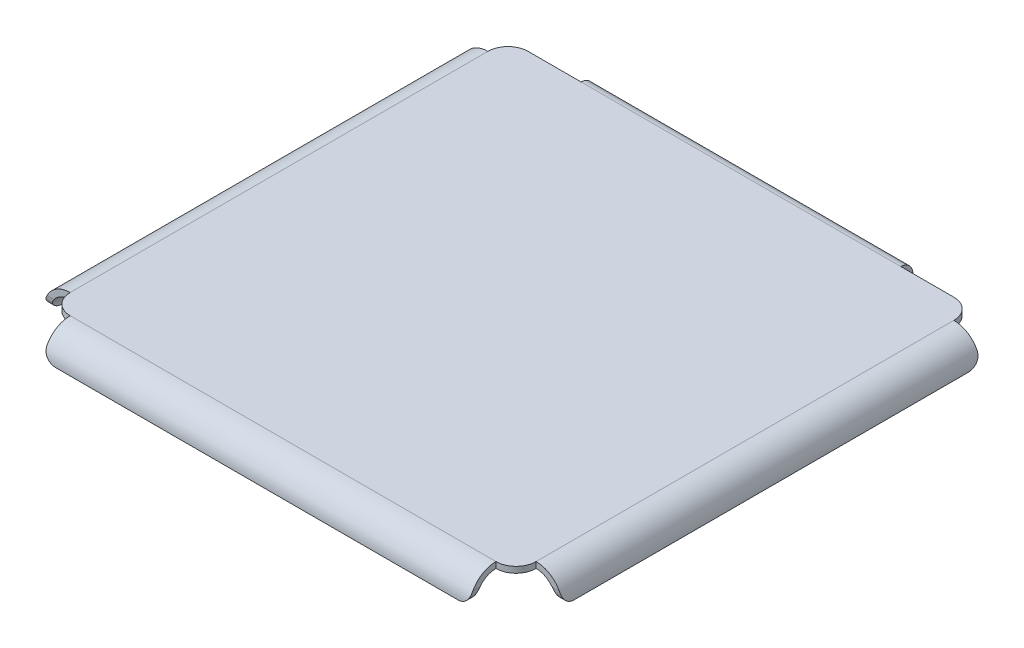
ISO-10303-21;
HEADER;
FILE_DESCRIPTION(('STEP AP214'),'2;1');
FILE_NAME('part.step','',(''),(''),'','','');
FILE_SCHEMA(('AUTOMOTIVE_DESIGN { 1 0 10303 214 1 1 1 1 }'));
ENDSEC;
DATA;
#1=APPLICATION_CONTEXT('core data for automotive mechanical design processes');
#2=APPLICATION_PROTOCOL_DEFINITION('international standard','automotive_design',2000,#1);
#3=PRODUCT_CONTEXT('',#1,'mechanical');
#4=PRODUCT('Part','Part','',(#3));
#5=PRODUCT_RELATED_PRODUCT_CATEGORY('part','',(#4));
#6=PRODUCT_DEFINITION_FORMATION('','',#4);
#7=PRODUCT_DEFINITION_CONTEXT('part definition',#1,'design');
#8=PRODUCT_DEFINITION('design','',#6,#7);
#9=PRODUCT_DEFINITION_SHAPE('','',#8);
#10=(LENGTH_UNIT() NAMED_UNIT(*) SI_UNIT(.MILLI.,.METRE.));
#11=(NAMED_UNIT(*) PLANE_ANGLE_UNIT() SI_UNIT($,.RADIAN.));
#12=(NAMED_UNIT(*) SI_UNIT($,.STERADIAN.) SOLID_ANGLE_UNIT());
#13=UNCERTAINTY_MEASURE_WITH_UNIT(LENGTH_MEASURE(1.E-05),#10,'distance_accuracy_value','');
#14=(GEOMETRIC_REPRESENTATION_CONTEXT(3) GLOBAL_UNCERTAINTY_ASSIGNED_CONTEXT((#13)) GLOBAL_UNIT_ASSIGNED_CONTEXT((#10,
#11,#12)) REPRESENTATION_CONTEXT('',''));
#15=CARTESIAN_POINT('',(0.,0.,0.));
#16=DIRECTION('',(0.,0.,1.));
#17=DIRECTION('',(1.,0.,0.));
#18=AXIS2_PLACEMENT_3D('',#15,#16,#17);
#19=CARTESIAN_POINT('',(-39.8,-3.75,1.5));
#20=DIRECTION('',(1.,0.,0.));
#21=DIRECTION('',(0.,-1.,0.));
#22=AXIS2_PLACEMENT_3D('',#19,#20,#21);
#23=PLANE('',#22);
#24=DIRECTION('',(0.,0.,1.));
#25=VECTOR('',#24,1.);
#26=CARTESIAN_POINT('',(-39.8,3.75,1.5));
#27=LINE('',#26,#25);
#28=CARTESIAN_POINT('',(-39.8,3.75,0.));
#29=VERTEX_POINT('',#28);
#30=CARTESIAN_POINT('',(-39.8,3.75,1.5));
#31=VERTEX_POINT('',#30);
#32=EDGE_CURVE('E433',#29,#31,#27,.T.);
#33=ORIENTED_EDGE('',*,*,#32,.F.);
#34=DIRECTION('',(0.,1.,0.));
#35=VECTOR('',#34,1.);
#36=CARTESIAN_POINT('',(-39.8,0.,0.));
#37=LINE('',#36,#35);
#38=CARTESIAN_POINT('',(-39.8,-3.75,0.));
#39=VERTEX_POINT('',#38);
#40=EDGE_CURVE('E424',#29,#39,#37,.F.);
#41=ORIENTED_EDGE('',*,*,#40,.T.);
#42=DIRECTION('',(0.,0.,1.));
#43=VECTOR('',#42,1.);
#44=CARTESIAN_POINT('',(-39.8,-3.75,1.5));
#45=LINE('',#44,#43);
#46=CARTESIAN_POINT('',(-39.8,-3.75,1.5));
#47=VERTEX_POINT('',#46);
#48=EDGE_CURVE('E431',#39,#47,#45,.T.);
#49=ORIENTED_EDGE('',*,*,#48,.T.);
#50=DIRECTION('',(0.,-1.,0.));
#51=VECTOR('',#50,1.);
#52=CARTESIAN_POINT('',(-39.8,-3.75,1.5));
#53=LINE('',#52,#51);
#54=EDGE_CURVE('E412',#31,#47,#53,.T.);
#55=ORIENTED_EDGE('',*,*,#54,.F.);
#56=EDGE_LOOP('',(#33,#41,#49,#55));
#57=FACE_BOUND('',#56,.T.);
#58=ADVANCED_FACE('F123',(#57),#23,.F.);
#59=CARTESIAN_POINT('',(-39.8,-3.75,1.5));
#60=DIRECTION('',(0.,1.,0.));
#61=DIRECTION('',(1.,0.,0.));
#62=AXIS2_PLACEMENT_3D('',#59,#60,#61);
#63=PLANE('',#62);
#64=ORIENTED_EDGE('',*,*,#48,.F.);
#65=DIRECTION('',(-1.,0.,0.));
#66=VECTOR('',#65,1.);
#67=CARTESIAN_POINT('',(0.,-3.75,0.));
#68=LINE('',#67,#66);
#69=CARTESIAN_POINT('',(39.8,-3.75,0.));
#70=VERTEX_POINT('',#69);
#71=EDGE_CURVE('E410',#39,#70,#68,.F.);
#72=ORIENTED_EDGE('',*,*,#71,.T.);
#73=DIRECTION('',(0.,0.,1.));
#74=VECTOR('',#73,1.);
#75=CARTESIAN_POINT('',(39.8,-3.75,1.5));
#76=LINE('',#75,#74);
#77=CARTESIAN_POINT('',(39.8,-3.75,1.5));
#78=VERTEX_POINT('',#77);
#79=EDGE_CURVE('E429',#70,#78,#76,.T.);
#80=ORIENTED_EDGE('',*,*,#79,.T.);
#81=DIRECTION('',(1.,0.,0.));
#82=VECTOR('',#81,1.);
#83=CARTESIAN_POINT('',(-39.8,-3.75,1.5));
#84=LINE('',#83,#82);
#85=EDGE_CURVE('E415',#47,#78,#84,.T.);
#86=ORIENTED_EDGE('',*,*,#85,.F.);
#87=EDGE_LOOP('',(#64,#72,#80,#86));
#88=FACE_BOUND('',#87,.T.);
#89=ADVANCED_FACE('F747',(#88),#63,.F.);
#90=CARTESIAN_POINT('',(39.8,-3.75,1.5));
#91=DIRECTION('',(-1.,0.,0.));
#92=DIRECTION('',(0.,1.,0.));
#93=AXIS2_PLACEMENT_3D('',#90,#91,#92);
#94=PLANE('',#93);
#95=ORIENTED_EDGE('',*,*,#79,.F.);
#96=DIRECTION('',(0.,1.,0.));
#97=VECTOR('',#96,1.);
#98=CARTESIAN_POINT('',(39.8,0.,0.));
#99=LINE('',#98,#97);
#100=CARTESIAN_POINT('',(39.8,3.75,0.));
#101=VERTEX_POINT('',#100);
#102=EDGE_CURVE('E400',#70,#101,#99,.T.);
#103=ORIENTED_EDGE('',*,*,#102,.T.);
#104=DIRECTION('',(0.,0.,1.));
#105=VECTOR('',#104,1.);
#106=CARTESIAN_POINT('',(39.8,3.75,1.5));
#107=LINE('',#106,#105);
#108=CARTESIAN_POINT('',(39.8,3.75,1.5));
#109=VERTEX_POINT('',#108);
#110=EDGE_CURVE('E418',#101,#109,#107,.T.);
#111=ORIENTED_EDGE('',*,*,#110,.T.);
#112=DIRECTION('',(0.,1.,0.));
#113=VECTOR('',#112,1.);
#114=CARTESIAN_POINT('',(39.8,-3.75,1.5));
#115=LINE('',#114,#113);
#116=EDGE_CURVE('E406',#78,#109,#115,.T.);
#117=ORIENTED_EDGE('',*,*,#116,.F.);
#118=EDGE_LOOP('',(#95,#103,#111,#117));
#119=FACE_BOUND('',#118,.T.);
#120=ADVANCED_FACE('F753',(#119),#94,.F.);
#121=CARTESIAN_POINT('',(0.,0.,1.5));
#122=DIRECTION('',(0.,0.,-1.));
#123=DIRECTION('',(-1.,0.,0.));
#124=AXIS2_PLACEMENT_3D('',#121,#122,#123);
#125=PLANE('',#124);
#126=CARTESIAN_POINT('',(35.5,-0.25,1.5));
#127=DIRECTION('',(0.,0.,-1.));
#128=DIRECTION('',(-1.,0.,0.));
#129=AXIS2_PLACEMENT_3D('',#126,#127,#128);
#130=CIRCLE('',#129,2.74999999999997);
#131=CARTESIAN_POINT('',(32.75,-0.25,1.5));
#132=VERTEX_POINT('',#131);
#133=EDGE_CURVE('E446',#132,#132,#130,.T.);
#134=ORIENTED_EDGE('',*,*,#133,.T.);
#135=EDGE_LOOP('',(#134));
#136=FACE_BOUND('',#135,.T.);
#137=CARTESIAN_POINT('',(0.,-0.250000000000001,1.5));
#138=DIRECTION('',(0.,0.,-1.));
#139=DIRECTION('',(-1.,0.,0.));
#140=AXIS2_PLACEMENT_3D('',#137,#138,#139);
#141=CIRCLE('',#140,2.74999999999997);
#142=CARTESIAN_POINT('',(-2.74999999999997,-0.250000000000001,1.5));
#143=VERTEX_POINT('',#142);
#144=EDGE_CURVE('E443',#143,#143,#141,.T.);
#145=ORIENTED_EDGE('',*,*,#144,.T.);
#146=EDGE_LOOP('',(#145));
#147=FACE_BOUND('',#146,.T.);
#148=CARTESIAN_POINT('',(-35.5,-0.250000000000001,1.5));
#149=DIRECTION('',(0.,0.,-1.));
#150=DIRECTION('',(-1.,0.,0.));
#151=AXIS2_PLACEMENT_3D('',#148,#149,#150);
#152=CIRCLE('',#151,2.74999999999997);
#153=CARTESIAN_POINT('',(-38.25,-0.250000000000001,1.5));
#154=VERTEX_POINT('',#153);
#155=EDGE_CURVE('E440',#154,#154,#152,.T.);
#156=ORIENTED_EDGE('',*,*,#155,.T.);
#157=EDGE_LOOP('',(#156));
#158=FACE_BOUND('',#157,.T.);
#159=ORIENTED_EDGE('',*,*,#116,.T.);
#160=DIRECTION('',(-1.,0.,0.));
#161=VECTOR('',#160,1.);
#162=CARTESIAN_POINT('',(-39.8,3.75,1.5));
#163=LINE('',#162,#161);
#164=EDGE_CURVE('E409',#109,#31,#163,.T.);
#165=ORIENTED_EDGE('',*,*,#164,.T.);
#166=ORIENTED_EDGE('',*,*,#54,.T.);
#167=ORIENTED_EDGE('',*,*,#85,.T.);
#168=EDGE_LOOP('',(#159,#165,#166,#167));
#169=FACE_BOUND('',#168,.T.);
#170=ADVANCED_FACE('F914',(#136,#147,#158,#169),#125,.F.);
#171=CARTESIAN_POINT('',(0.,0.,0.));
#172=DIRECTION('',(0.,0.,-1.));
#173=DIRECTION('',(-1.,0.,0.));
#174=AXIS2_PLACEMENT_3D('',#171,#172,#173);
#175=PLANE('',#174);
#176=CARTESIAN_POINT('',(0.,-0.250000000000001,0.));
#177=DIRECTION('',(0.,0.,1.));
#178=DIRECTION('',(1.,0.,0.));
#179=AXIS2_PLACEMENT_3D('',#176,#177,#178);
#180=CIRCLE('',#179,1.45);
#181=CARTESIAN_POINT('',(1.45,-0.250000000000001,0.));
#182=VERTEX_POINT('',#181);
#183=EDGE_CURVE('E720',#182,#182,#180,.T.);
#184=ORIENTED_EDGE('',*,*,#183,.T.);
#185=EDGE_LOOP('',(#184));
#186=FACE_BOUND('',#185,.T.);
#187=CARTESIAN_POINT('',(35.5,-0.25,0.));
#188=DIRECTION('',(0.,0.,1.));
#189=DIRECTION('',(1.,0.,0.));
#190=AXIS2_PLACEMENT_3D('',#187,#188,#189);
#191=CIRCLE('',#190,1.45);
#192=CARTESIAN_POINT('',(36.95,-0.25,0.));
#193=VERTEX_POINT('',#192);
#194=EDGE_CURVE('E721',#193,#193,#191,.T.);
#195=ORIENTED_EDGE('',*,*,#194,.T.);
#196=EDGE_LOOP('',(#195));
#197=FACE_BOUND('',#196,.T.);
#198=CARTESIAN_POINT('',(-35.5,-0.250000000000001,0.));
#199=DIRECTION('',(0.,0.,1.));
#200=DIRECTION('',(1.,0.,0.));
#201=AXIS2_PLACEMENT_3D('',#198,#199,#200);
#202=CIRCLE('',#201,1.45);
#203=CARTESIAN_POINT('',(-34.05,-0.250000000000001,0.));
#204=VERTEX_POINT('',#203);
#205=EDGE_CURVE('E711',#204,#204,#202,.T.);
#206=ORIENTED_EDGE('',*,*,#205,.T.);
#207=EDGE_LOOP('',(#206));
#208=FACE_BOUND('',#207,.T.);
#209=ORIENTED_EDGE('',*,*,#102,.F.);
#210=ORIENTED_EDGE('',*,*,#71,.F.);
#211=ORIENTED_EDGE('',*,*,#40,.F.);
#212=DIRECTION('',(-1.,0.,0.));
#213=VECTOR('',#212,1.);
#214=CARTESIAN_POINT('',(0.,3.75,0.));
#215=LINE('',#214,#213);
#216=EDGE_CURVE('E421',#101,#29,#215,.T.);
#217=ORIENTED_EDGE('',*,*,#216,.F.);
#218=EDGE_LOOP('',(#209,#210,#211,#217));
#219=FACE_BOUND('',#218,.T.);
#220=ADVANCED_FACE('F727',(#186,#197,#208,#219),#175,.T.);
#221=CARTESIAN_POINT('',(39.8,3.75,3.));
#222=DIRECTION('',(1.,0.,0.));
#223=DIRECTION('',(0.,0.,-1.));
#224=AXIS2_PLACEMENT_3D('',#221,#222,#223);
#225=PLANE('',#224);
#226=DIRECTION('',(0.,1.,0.));
#227=VECTOR('',#226,1.);
#228=CARTESIAN_POINT('',(39.8,6.75,2.99999999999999));
#229=LINE('',#228,#227);
#230=CARTESIAN_POINT('',(39.8,5.25,3.));
#231=VERTEX_POINT('',#230);
#232=CARTESIAN_POINT('',(39.8,6.75,2.99999999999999));
#233=VERTEX_POINT('',#232);
#234=EDGE_CURVE('E367',#231,#233,#229,.T.);
#235=ORIENTED_EDGE('',*,*,#234,.F.);
#236=CARTESIAN_POINT('',(39.8,3.75,3.));
#237=DIRECTION('',(-1.,0.,0.));
#238=DIRECTION('',(0.,0.,1.));
#239=AXIS2_PLACEMENT_3D('',#236,#237,#238);
#240=CIRCLE('',#239,1.5);
#241=EDGE_CURVE('E378',#109,#231,#240,.F.);
#242=ORIENTED_EDGE('',*,*,#241,.F.);
#243=ORIENTED_EDGE('',*,*,#110,.F.);
#244=CARTESIAN_POINT('',(39.8,3.75,3.));
#245=DIRECTION('',(-1.,0.,0.));
#246=DIRECTION('',(0.,0.,1.));
#247=AXIS2_PLACEMENT_3D('',#244,#245,#246);
#248=CIRCLE('',#247,3.);
#249=EDGE_CURVE('E397',#101,#233,#248,.F.);
#250=ORIENTED_EDGE('',*,*,#249,.T.);
#251=EDGE_LOOP('',(#235,#242,#243,#250));
#252=FACE_BOUND('',#251,.T.);
#253=ADVANCED_FACE('F652',(#252),#225,.T.);
#254=CARTESIAN_POINT('',(-39.8,3.75,3.));
#255=DIRECTION('',(1.,0.,0.));
#256=DIRECTION('',(0.,0.,-1.));
#257=AXIS2_PLACEMENT_3D('',#254,#255,#256);
#258=PLANE('',#257);
#259=CARTESIAN_POINT('',(-39.8,3.75,3.));
#260=DIRECTION('',(-1.,0.,0.));
#261=DIRECTION('',(0.,0.,1.));
#262=AXIS2_PLACEMENT_3D('',#259,#260,#261);
#263=CIRCLE('',#262,1.5);
#264=CARTESIAN_POINT('',(-39.8,5.25,3.));
#265=VERTEX_POINT('',#264);
#266=EDGE_CURVE('E374',#265,#31,#263,.T.);
#267=ORIENTED_EDGE('',*,*,#266,.F.);
#268=DIRECTION('',(0.,1.,0.));
#269=VECTOR('',#268,1.);
#270=CARTESIAN_POINT('',(-39.8,5.25,3.));
#271=LINE('',#270,#269);
#272=CARTESIAN_POINT('',(-39.8,6.75,2.99999999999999));
#273=VERTEX_POINT('',#272);
#274=EDGE_CURVE('E389',#265,#273,#271,.T.);
#275=ORIENTED_EDGE('',*,*,#274,.T.);
#276=CARTESIAN_POINT('',(-39.8,3.75,3.));
#277=DIRECTION('',(-1.,0.,0.));
#278=DIRECTION('',(0.,0.,1.));
#279=AXIS2_PLACEMENT_3D('',#276,#277,#278);
#280=CIRCLE('',#279,3.);
#281=EDGE_CURVE('E401',#273,#29,#280,.T.);
#282=ORIENTED_EDGE('',*,*,#281,.T.);
#283=ORIENTED_EDGE('',*,*,#32,.T.);
#284=EDGE_LOOP('',(#267,#275,#282,#283));
#285=FACE_BOUND('',#284,.T.);
#286=ADVANCED_FACE('F905',(#285),#258,.F.);
#287=CARTESIAN_POINT('',(-39.8,3.75,3.));
#288=DIRECTION('',(-1.,0.,0.));
#289=DIRECTION('',(0.,1.,0.));
#290=AXIS2_PLACEMENT_3D('',#287,#288,#289);
#291=CYLINDRICAL_SURFACE('',#290,3.);
#292=ORIENTED_EDGE('',*,*,#216,.T.);
#293=ORIENTED_EDGE('',*,*,#281,.F.);
#294=DIRECTION('',(-1.,0.,0.));
#295=VECTOR('',#294,1.);
#296=CARTESIAN_POINT('',(0.,6.75,2.99999999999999));
#297=LINE('',#296,#295);
#298=EDGE_CURVE('E381',#233,#273,#297,.T.);
#299=ORIENTED_EDGE('',*,*,#298,.F.);
#300=ORIENTED_EDGE('',*,*,#249,.F.);
#301=EDGE_LOOP('',(#292,#293,#299,#300));
#302=FACE_BOUND('',#301,.T.);
#303=ADVANCED_FACE('F649',(#302),#291,.T.);
#304=CARTESIAN_POINT('',(-39.8,3.75,3.));
#305=DIRECTION('',(-1.,0.,0.));
#306=DIRECTION('',(0.,1.,0.));
#307=AXIS2_PLACEMENT_3D('',#304,#305,#306);
#308=CYLINDRICAL_SURFACE('',#307,1.5);
#309=ORIENTED_EDGE('',*,*,#164,.F.);
#310=ORIENTED_EDGE('',*,*,#241,.T.);
#311=DIRECTION('',(1.,0.,0.));
#312=VECTOR('',#311,1.);
#313=CARTESIAN_POINT('',(39.8,5.25,2.99999999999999));
#314=LINE('',#313,#312);
#315=EDGE_CURVE('E392',#231,#265,#314,.F.);
#316=ORIENTED_EDGE('',*,*,#315,.T.);
#317=ORIENTED_EDGE('',*,*,#266,.T.);
#318=EDGE_LOOP('',(#309,#310,#316,#317));
#319=FACE_BOUND('',#318,.T.);
#320=ADVANCED_FACE('F900',(#319),#308,.F.);
#321=CARTESIAN_POINT('',(0.,6.74999999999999,0.));
#322=DIRECTION('',(0.,1.,0.));
#323=DIRECTION('',(0.,0.,1.));
#324=AXIS2_PLACEMENT_3D('',#321,#322,#323);
#325=PLANE('',#324);
#326=DIRECTION('',(-1.,0.,0.));
#327=VECTOR('',#326,1.);
#328=CARTESIAN_POINT('',(-39.8,6.7500000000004,117.));
#329=LINE('',#328,#327);
#330=CARTESIAN_POINT('',(53.,6.7500000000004,117.));
#331=VERTEX_POINT('',#330);
#332=CARTESIAN_POINT('',(-53.,6.75000000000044,117.));
#333=VERTEX_POINT('',#332);
#334=EDGE_CURVE('E354',#331,#333,#329,.T.);
#335=ORIENTED_EDGE('',*,*,#334,.F.);
#336=CARTESIAN_POINT('',(53.,6.75000000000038,112.));
#337=DIRECTION('',(0.,1.,0.));
#338=DIRECTION('',(0.,0.,-1.));
#339=AXIS2_PLACEMENT_3D('',#336,#337,#338);
#340=CIRCLE('',#339,4.99999999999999);
#341=CARTESIAN_POINT('',(58.,6.75000000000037,112.));
#342=VERTEX_POINT('',#341);
#343=EDGE_CURVE('E603',#331,#342,#340,.T.);
#344=ORIENTED_EDGE('',*,*,#343,.T.);
#345=DIRECTION('',(0.,0.,-1.));
#346=VECTOR('',#345,1.);
#347=CARTESIAN_POINT('',(58.,6.75000000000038,112.));
#348=LINE('',#347,#346);
#349=CARTESIAN_POINT('',(58.,6.75000000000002,8.));
#350=VERTEX_POINT('',#349);
#351=EDGE_CURVE('E605',#342,#350,#348,.T.);
#352=ORIENTED_EDGE('',*,*,#351,.T.);
#353=CARTESIAN_POINT('',(53.,6.75000000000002,8.));
#354=DIRECTION('',(0.,1.,0.));
#355=DIRECTION('',(0.,0.,1.));
#356=AXIS2_PLACEMENT_3D('',#353,#354,#355);
#357=CIRCLE('',#356,5.00000000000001);
#358=CARTESIAN_POINT('',(53.,6.75,2.99999999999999));
#359=VERTEX_POINT('',#358);
#360=EDGE_CURVE('E592',#350,#359,#357,.T.);
#361=ORIENTED_EDGE('',*,*,#360,.T.);
#362=DIRECTION('',(-1.,0.,0.));
#363=VECTOR('',#362,1.);
#364=CARTESIAN_POINT('',(53.,6.75,2.99999999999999));
#365=LINE('',#364,#363);
#366=EDGE_CURVE('E582',#359,#233,#365,.T.);
#367=ORIENTED_EDGE('',*,*,#366,.T.);
#368=ORIENTED_EDGE('',*,*,#298,.T.);
#369=DIRECTION('',(-1.,0.,0.));
#370=VECTOR('',#369,1.);
#371=CARTESIAN_POINT('',(-53.,6.75,2.99999999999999));
#372=LINE('',#371,#370);
#373=CARTESIAN_POINT('',(-53.,6.75,2.99999999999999));
#374=VERTEX_POINT('',#373);
#375=EDGE_CURVE('E612',#273,#374,#372,.T.);
#376=ORIENTED_EDGE('',*,*,#375,.T.);
#377=CARTESIAN_POINT('',(-53.,6.75000000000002,8.));
#378=DIRECTION('',(0.,1.,0.));
#379=DIRECTION('',(0.,0.,1.));
#380=AXIS2_PLACEMENT_3D('',#377,#378,#379);
#381=CIRCLE('',#380,5.);
#382=CARTESIAN_POINT('',(-58.,6.75000000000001,8.));
#383=VERTEX_POINT('',#382);
#384=EDGE_CURVE('E631',#374,#383,#381,.T.);
#385=ORIENTED_EDGE('',*,*,#384,.T.);
#386=DIRECTION('',(0.,0.,1.));
#387=VECTOR('',#386,1.);
#388=CARTESIAN_POINT('',(-58.,6.75000000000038,112.));
#389=LINE('',#388,#387);
#390=CARTESIAN_POINT('',(-58.,6.75000000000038,112.));
#391=VERTEX_POINT('',#390);
#392=EDGE_CURVE('E358',#383,#391,#389,.T.);
#393=ORIENTED_EDGE('',*,*,#392,.T.);
#394=CARTESIAN_POINT('',(-53.,6.75000000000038,112.));
#395=DIRECTION('',(0.,1.,0.));
#396=DIRECTION('',(0.,0.,-1.));
#397=AXIS2_PLACEMENT_3D('',#394,#395,#396);
#398=CIRCLE('',#397,4.99999999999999);
#399=EDGE_CURVE('E351',#391,#333,#398,.T.);
#400=ORIENTED_EDGE('',*,*,#399,.T.);
#401=EDGE_LOOP('',(#335,#344,#352,#361,#367,#368,#376,#385,#393,#400));
#402=FACE_BOUND('',#401,.T.);
#403=ADVANCED_FACE('F352',(#402),#325,.T.);
#404=CARTESIAN_POINT('',(0.,5.24999999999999,0.));
#405=DIRECTION('',(0.,1.,0.));
#406=DIRECTION('',(0.,0.,1.));
#407=AXIS2_PLACEMENT_3D('',#404,#405,#406);
#408=PLANE('',#407);
#409=ORIENTED_EDGE('',*,*,#315,.F.);
#410=DIRECTION('',(-1.,0.,0.));
#411=VECTOR('',#410,1.);
#412=CARTESIAN_POINT('',(53.,5.25,3.));
#413=LINE('',#412,#411);
#414=CARTESIAN_POINT('',(53.,5.25,3.));
#415=VERTEX_POINT('',#414);
#416=EDGE_CURVE('E588',#415,#231,#413,.T.);
#417=ORIENTED_EDGE('',*,*,#416,.F.);
#418=CARTESIAN_POINT('',(53.,5.25000000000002,8.));
#419=DIRECTION('',(0.,1.,0.));
#420=DIRECTION('',(0.,0.,1.));
#421=AXIS2_PLACEMENT_3D('',#418,#419,#420);
#422=CIRCLE('',#421,5.00000000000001);
#423=CARTESIAN_POINT('',(58.,5.25,8.00000000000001));
#424=VERTEX_POINT('',#423);
#425=EDGE_CURVE('E597',#424,#415,#422,.T.);
#426=ORIENTED_EDGE('',*,*,#425,.F.);
#427=DIRECTION('',(0.,0.,-1.));
#428=VECTOR('',#427,1.);
#429=CARTESIAN_POINT('',(58.,5.25000000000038,112.));
#430=LINE('',#429,#428);
#431=CARTESIAN_POINT('',(58.,5.25000000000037,112.));
#432=VERTEX_POINT('',#431);
#433=EDGE_CURVE('E595',#432,#424,#430,.T.);
#434=ORIENTED_EDGE('',*,*,#433,.F.);
#435=CARTESIAN_POINT('',(53.,5.25000000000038,112.));
#436=DIRECTION('',(0.,1.,0.));
#437=DIRECTION('',(0.,0.,-1.));
#438=AXIS2_PLACEMENT_3D('',#435,#436,#437);
#439=CIRCLE('',#438,4.99999999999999);
#440=CARTESIAN_POINT('',(53.,5.2500000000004,117.));
#441=VERTEX_POINT('',#440);
#442=EDGE_CURVE('E591',#441,#432,#439,.T.);
#443=ORIENTED_EDGE('',*,*,#442,.F.);
#444=DIRECTION('',(1.,0.,0.));
#445=VECTOR('',#444,1.);
#446=CARTESIAN_POINT('',(0.,5.2500000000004,117.));
#447=LINE('',#446,#445);
#448=CARTESIAN_POINT('',(-53.,5.2500000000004,117.));
#449=VERTEX_POINT('',#448);
#450=EDGE_CURVE('E375',#441,#449,#447,.F.);
#451=ORIENTED_EDGE('',*,*,#450,.T.);
#452=CARTESIAN_POINT('',(-53.,5.25000000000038,112.));
#453=DIRECTION('',(0.,1.,0.));
#454=DIRECTION('',(0.,0.,-1.));
#455=AXIS2_PLACEMENT_3D('',#452,#453,#454);
#456=CIRCLE('',#455,4.99999999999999);
#457=CARTESIAN_POINT('',(-58.,5.25000000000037,112.));
#458=VERTEX_POINT('',#457);
#459=EDGE_CURVE('E366',#458,#449,#456,.T.);
#460=ORIENTED_EDGE('',*,*,#459,.F.);
#461=DIRECTION('',(0.,0.,1.));
#462=VECTOR('',#461,1.);
#463=CARTESIAN_POINT('',(-58.,5.25000000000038,112.));
#464=LINE('',#463,#462);
#465=CARTESIAN_POINT('',(-58.,5.25000000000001,8.));
#466=VERTEX_POINT('',#465);
#467=EDGE_CURVE('E626',#466,#458,#464,.T.);
#468=ORIENTED_EDGE('',*,*,#467,.F.);
#469=CARTESIAN_POINT('',(-53.,5.25000000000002,8.));
#470=DIRECTION('',(0.,1.,0.));
#471=DIRECTION('',(0.,0.,1.));
#472=AXIS2_PLACEMENT_3D('',#469,#470,#471);
#473=CIRCLE('',#472,5.);
#474=CARTESIAN_POINT('',(-53.,5.25,3.));
#475=VERTEX_POINT('',#474);
#476=EDGE_CURVE('E623',#475,#466,#473,.T.);
#477=ORIENTED_EDGE('',*,*,#476,.F.);
#478=DIRECTION('',(-1.,0.,0.));
#479=VECTOR('',#478,1.);
#480=CARTESIAN_POINT('',(-53.,5.25,3.));
#481=LINE('',#480,#479);
#482=EDGE_CURVE('E361',#265,#475,#481,.T.);
#483=ORIENTED_EDGE('',*,*,#482,.F.);
#484=EDGE_LOOP('',(#409,#417,#426,#434,#443,#451,#460,#468,#477,#483));
#485=FACE_BOUND('',#484,.T.);
#486=ADVANCED_FACE('F660',(#485),#408,.F.);
#487=CARTESIAN_POINT('',(-53.,5.25000000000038,112.));
#488=DIRECTION('',(0.,1.,0.));
#489=DIRECTION('',(0.,0.,1.));
#490=AXIS2_PLACEMENT_3D('',#487,#488,#489);
#491=CYLINDRICAL_SURFACE('',#490,4.99999999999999);
#492=ORIENTED_EDGE('',*,*,#399,.F.);
#493=DIRECTION('',(0.,1.,0.));
#494=VECTOR('',#493,1.);
#495=CARTESIAN_POINT('',(-58.,5.25000000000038,112.));
#496=LINE('',#495,#494);
#497=EDGE_CURVE('E368',#458,#391,#496,.T.);
#498=ORIENTED_EDGE('',*,*,#497,.F.);
#499=ORIENTED_EDGE('',*,*,#459,.T.);
#500=DIRECTION('',(0.,1.,0.));
#501=VECTOR('',#500,1.);
#502=CARTESIAN_POINT('',(-53.,5.2500000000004,117.));
#503=LINE('',#502,#501);
#504=EDGE_CURVE('E339',#449,#333,#503,.T.);
#505=ORIENTED_EDGE('',*,*,#504,.T.);
#506=EDGE_LOOP('',(#492,#498,#499,#505));
#507=FACE_BOUND('',#506,.T.);
#508=ADVANCED_FACE('F364',(#507),#491,.T.);
#509=CARTESIAN_POINT('',(-53.,5.25000000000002,8.));
#510=DIRECTION('',(0.,1.,0.));
#511=DIRECTION('',(0.,0.,1.));
#512=AXIS2_PLACEMENT_3D('',#509,#510,#511);
#513=CYLINDRICAL_SURFACE('',#512,5.);
#514=ORIENTED_EDGE('',*,*,#384,.F.);
#515=DIRECTION('',(0.,1.,0.));
#516=VECTOR('',#515,1.);
#517=CARTESIAN_POINT('',(-53.,5.25,3.));
#518=LINE('',#517,#516);
#519=EDGE_CURVE('E384',#475,#374,#518,.T.);
#520=ORIENTED_EDGE('',*,*,#519,.F.);
#521=ORIENTED_EDGE('',*,*,#476,.T.);
#522=DIRECTION('',(0.,1.,0.));
#523=VECTOR('',#522,1.);
#524=CARTESIAN_POINT('',(-58.,5.25000000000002,8.));
#525=LINE('',#524,#523);
#526=EDGE_CURVE('E635',#466,#383,#525,.T.);
#527=ORIENTED_EDGE('',*,*,#526,.T.);
#528=EDGE_LOOP('',(#514,#520,#521,#527));
#529=FACE_BOUND('',#528,.T.);
#530=ADVANCED_FACE('F645',(#529),#513,.T.);
#531=CARTESIAN_POINT('',(-53.,5.25,3.));
#532=DIRECTION('',(0.,0.,-1.));
#533=DIRECTION('',(0.,1.,0.));
#534=AXIS2_PLACEMENT_3D('',#531,#532,#533);
#535=PLANE('',#534);
#536=ORIENTED_EDGE('',*,*,#375,.F.);
#537=ORIENTED_EDGE('',*,*,#274,.F.);
#538=ORIENTED_EDGE('',*,*,#482,.T.);
#539=ORIENTED_EDGE('',*,*,#519,.T.);
#540=EDGE_LOOP('',(#536,#537,#538,#539));
#541=FACE_BOUND('',#540,.T.);
#542=ADVANCED_FACE('F641',(#541),#535,.T.);
#543=CARTESIAN_POINT('',(53.,5.25,3.));
#544=DIRECTION('',(0.,0.,-1.));
#545=DIRECTION('',(0.,1.,0.));
#546=AXIS2_PLACEMENT_3D('',#543,#544,#545);
#547=PLANE('',#546);
#548=ORIENTED_EDGE('',*,*,#366,.F.);
#549=DIRECTION('',(0.,1.,0.));
#550=VECTOR('',#549,1.);
#551=CARTESIAN_POINT('',(53.,5.25,3.));
#552=LINE('',#551,#550);
#553=EDGE_CURVE('E610',#415,#359,#552,.T.);
#554=ORIENTED_EDGE('',*,*,#553,.F.);
#555=ORIENTED_EDGE('',*,*,#416,.T.);
#556=ORIENTED_EDGE('',*,*,#234,.T.);
#557=EDGE_LOOP('',(#548,#554,#555,#556));
#558=FACE_BOUND('',#557,.T.);
#559=ADVANCED_FACE('F655',(#558),#547,.T.);
#560=CARTESIAN_POINT('',(53.,5.25000000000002,8.));
#561=DIRECTION('',(0.,1.,0.));
#562=DIRECTION('',(0.,0.,1.));
#563=AXIS2_PLACEMENT_3D('',#560,#561,#562);
#564=CYLINDRICAL_SURFACE('',#563,5.00000000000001);
#565=ORIENTED_EDGE('',*,*,#360,.F.);
#566=DIRECTION('',(0.,1.,0.));
#567=VECTOR('',#566,1.);
#568=CARTESIAN_POINT('',(58.,5.25000000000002,8.));
#569=LINE('',#568,#567);
#570=EDGE_CURVE('E613',#424,#350,#569,.T.);
#571=ORIENTED_EDGE('',*,*,#570,.F.);
#572=ORIENTED_EDGE('',*,*,#425,.T.);
#573=ORIENTED_EDGE('',*,*,#553,.T.);
#574=EDGE_LOOP('',(#565,#571,#572,#573));
#575=FACE_BOUND('',#574,.T.);
#576=ADVANCED_FACE('F665',(#575),#564,.T.);
#577=CARTESIAN_POINT('',(53.,5.25000000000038,112.));
#578=DIRECTION('',(0.,1.,0.));
#579=DIRECTION('',(0.,0.,1.));
#580=AXIS2_PLACEMENT_3D('',#577,#578,#579);
#581=CYLINDRICAL_SURFACE('',#580,4.99999999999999);
#582=ORIENTED_EDGE('',*,*,#343,.F.);
#583=DIRECTION('',(0.,1.,0.));
#584=VECTOR('',#583,1.);
#585=CARTESIAN_POINT('',(53.,5.2500000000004,117.));
#586=LINE('',#585,#584);
#587=EDGE_CURVE('E600',#441,#331,#586,.T.);
#588=ORIENTED_EDGE('',*,*,#587,.F.);
#589=ORIENTED_EDGE('',*,*,#442,.T.);
#590=DIRECTION('',(0.,1.,0.));
#591=VECTOR('',#590,1.);
#592=CARTESIAN_POINT('',(58.,5.25000000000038,112.));
#593=LINE('',#592,#591);
#594=EDGE_CURVE('E616',#432,#342,#593,.T.);
#595=ORIENTED_EDGE('',*,*,#594,.T.);
#596=EDGE_LOOP('',(#582,#588,#589,#595));
#597=FACE_BOUND('',#596,.T.);
#598=ADVANCED_FACE('F679',(#597),#581,.T.);
#599=CARTESIAN_POINT('',(-58.,0.250000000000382,112.));
#600=DIRECTION('',(0.,0.,1.));
#601=DIRECTION('',(0.,-1.,0.));
#602=AXIS2_PLACEMENT_3D('',#599,#600,#601);
#603=PLANE('',#602);
#604=CARTESIAN_POINT('',(-58.,0.250000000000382,112.));
#605=DIRECTION('',(0.,0.,-1.));
#606=DIRECTION('',(0.,1.,0.));
#607=AXIS2_PLACEMENT_3D('',#604,#605,#606);
#608=CIRCLE('',#607,6.49999999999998);
#609=CARTESIAN_POINT('',(-63.7668014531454,3.2490000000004,112.));
#610=VERTEX_POINT('',#609);
#611=EDGE_CURVE('E579',#391,#610,#608,.F.);
#612=ORIENTED_EDGE('',*,*,#611,.T.);
#613=DIRECTION('',(1.,0.,0.));
#614=VECTOR('',#613,1.);
#615=CARTESIAN_POINT('',(-62.9999999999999,3.2490000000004,112.));
#616=LINE('',#615,#614);
#617=CARTESIAN_POINT('',(-62.0007498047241,3.24900000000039,112.));
#618=VERTEX_POINT('',#617);
#619=EDGE_CURVE('E872',#610,#618,#616,.T.);
#620=ORIENTED_EDGE('',*,*,#619,.T.);
#621=CARTESIAN_POINT('',(-58.,0.250000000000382,112.));
#622=DIRECTION('',(0.,0.,-1.));
#623=DIRECTION('',(0.,1.,0.));
#624=AXIS2_PLACEMENT_3D('',#621,#622,#623);
#625=CIRCLE('',#624,4.99999999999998);
#626=EDGE_CURVE('E584',#458,#618,#625,.F.);
#627=ORIENTED_EDGE('',*,*,#626,.F.);
#628=ORIENTED_EDGE('',*,*,#497,.T.);
#629=EDGE_LOOP('',(#612,#620,#627,#628));
#630=FACE_BOUND('',#629,.T.);
#631=ADVANCED_FACE('F879',(#630),#603,.T.);
#632=CARTESIAN_POINT('',(-58.,0.250000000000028,8.00000000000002));
#633=DIRECTION('',(0.,0.,1.));
#634=DIRECTION('',(0.,-1.,0.));
#635=AXIS2_PLACEMENT_3D('',#632,#633,#634);
#636=PLANE('',#635);
#637=CARTESIAN_POINT('',(-58.,0.250000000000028,8.00000000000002));
#638=DIRECTION('',(0.,0.,-1.));
#639=DIRECTION('',(0.,1.,0.));
#640=AXIS2_PLACEMENT_3D('',#637,#638,#639);
#641=CIRCLE('',#640,4.99999999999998);
#642=CARTESIAN_POINT('',(-62.0007498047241,3.24900000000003,8.00000000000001));
#643=VERTEX_POINT('',#642);
#644=EDGE_CURVE('E573',#643,#466,#641,.T.);
#645=ORIENTED_EDGE('',*,*,#644,.F.);
#646=DIRECTION('',(1.,0.,0.));
#647=VECTOR('',#646,1.);
#648=CARTESIAN_POINT('',(-64.5,3.24900000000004,8.00000000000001));
#649=LINE('',#648,#647);
#650=CARTESIAN_POINT('',(-63.7668014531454,3.24900000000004,8.00000000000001));
#651=VERTEX_POINT('',#650);
#652=EDGE_CURVE('E13',#643,#651,#649,.F.);
#653=ORIENTED_EDGE('',*,*,#652,.T.);
#654=CARTESIAN_POINT('',(-58.,0.250000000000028,8.00000000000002));
#655=DIRECTION('',(0.,0.,-1.));
#656=DIRECTION('',(0.,1.,0.));
#657=AXIS2_PLACEMENT_3D('',#654,#655,#656);
#658=CIRCLE('',#657,6.49999999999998);
#659=EDGE_CURVE('E556',#651,#383,#658,.T.);
#660=ORIENTED_EDGE('',*,*,#659,.T.);
#661=ORIENTED_EDGE('',*,*,#526,.F.);
#662=EDGE_LOOP('',(#645,#653,#660,#661));
#663=FACE_BOUND('',#662,.T.);
#664=ADVANCED_FACE('F509',(#663),#636,.F.);
#665=CARTESIAN_POINT('',(-58.,0.250000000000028,8.00000000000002));
#666=DIRECTION('',(0.,0.,-1.));
#667=DIRECTION('',(-1.,0.,0.));
#668=AXIS2_PLACEMENT_3D('',#665,#666,#667);
#669=CYLINDRICAL_SURFACE('',#668,6.49999999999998);
#670=DIRECTION('',(0.,0.,-1.));
#671=VECTOR('',#670,1.);
#672=CARTESIAN_POINT('',(-64.5,0.2500000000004,112.));
#673=LINE('',#672,#671);
#674=CARTESIAN_POINT('',(-64.5,0.250000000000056,10.9225467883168));
#675=VERTEX_POINT('',#674);
#676=CARTESIAN_POINT('',(-64.5,0.25000000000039,109.077453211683));
#677=VERTEX_POINT('',#676);
#678=EDGE_CURVE('E554',#675,#677,#673,.F.);
#679=ORIENTED_EDGE('',*,*,#678,.T.);
#680=CARTESIAN_POINT('',(-64.5,0.25000000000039,109.077453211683));
#681=CARTESIAN_POINT('',(-64.4999880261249,0.252164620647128,109.161576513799));
#682=CARTESIAN_POINT('',(-64.499998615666,0.257884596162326,109.245604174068));
#683=CARTESIAN_POINT('',(-64.4999562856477,0.276358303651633,109.412879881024));
#684=CARTESIAN_POINT('',(-64.4999033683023,0.289111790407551,109.496127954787));
#685=CARTESIAN_POINT('',(-64.4996254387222,0.321571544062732,109.661240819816));
#686=CARTESIAN_POINT('',(-64.4994004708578,0.34127601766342,109.743105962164));
#687=CARTESIAN_POINT('',(-64.4985867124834,0.387479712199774,109.904868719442));
#688=CARTESIAN_POINT('',(-64.4979979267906,0.413978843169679,109.984766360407));
#689=CARTESIAN_POINT('',(-64.4953343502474,0.503460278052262,110.220761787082));
#690=CARTESIAN_POINT('',(-64.4923624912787,0.576434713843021,110.373203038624));
#691=CARTESIAN_POINT('',(-64.4815476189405,0.746764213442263,110.663478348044));
#692=CARTESIAN_POINT('',(-64.4737057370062,0.844113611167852,110.801315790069));
#693=CARTESIAN_POINT('',(-64.450347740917,1.05904125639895,111.057103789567));
#694=CARTESIAN_POINT('',(-64.4349109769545,1.17640231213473,111.175243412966));
#695=CARTESIAN_POINT('',(-64.3936462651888,1.42790735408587,111.389751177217));
#696=CARTESIAN_POINT('',(-64.3678244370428,1.56204142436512,111.486132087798));
#697=CARTESIAN_POINT('',(-64.3048114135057,1.83698054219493,111.65160756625));
#698=CARTESIAN_POINT('',(-64.2680620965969,1.97737268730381,111.72155817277));
#699=CARTESIAN_POINT('',(-64.1819170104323,2.26402012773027,111.837913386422));
#700=CARTESIAN_POINT('',(-64.1325130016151,2.41027919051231,111.884302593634));
#701=CARTESIAN_POINT('',(-64.0326519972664,2.67336249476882,111.946694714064));
#702=CARTESIAN_POINT('',(-63.9844891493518,2.79007135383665,111.96697842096));
#703=CARTESIAN_POINT('',(-63.9067881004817,2.96364571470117,111.986965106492));
#704=CARTESIAN_POINT('',(-63.8800073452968,3.02119971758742,111.991887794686));
#705=CARTESIAN_POINT('',(-63.8246972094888,3.13564492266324,111.998405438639));
#706=CARTESIAN_POINT('',(-63.7961680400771,3.19253620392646,112.000000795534));
#707=CARTESIAN_POINT('',(-63.7668014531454,3.2490000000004,112.));
#708=B_SPLINE_CURVE_WITH_KNOTS('',3,(#680,#681,#682,#683,#684,#685,#686,#687,#688,#689,#690,
#691,#692,#693,#694,#695,#696,#697,#698,#699,#700,#701,#702,#703,#704,#705,#706,#707),
.UNSPECIFIED.,.F.,.F.,(4,2,2,2,2,2,2,2,2,2,2,2,2,4),(0.,0.252371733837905,0.504734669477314,
0.757032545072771,1.00932708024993,1.51379246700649,2.01814069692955,2.51732802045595,
3.01622161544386,3.49718837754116,3.97846910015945,4.36104026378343,4.55195010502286,
4.74283692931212),.UNSPECIFIED.);
#709=EDGE_CURVE('E132',#677,#610,#708,.T.);
#710=ORIENTED_EDGE('',*,*,#709,.T.);
#711=ORIENTED_EDGE('',*,*,#611,.F.);
#712=ORIENTED_EDGE('',*,*,#392,.F.);
#713=ORIENTED_EDGE('',*,*,#659,.F.);
#714=CARTESIAN_POINT('',(-63.7668014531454,3.24900000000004,8.00000000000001));
#715=CARTESIAN_POINT('',(-63.8053669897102,3.17487005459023,7.99999090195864));
#716=CARTESIAN_POINT('',(-63.8424902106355,3.09996594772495,8.00274777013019));
#717=CARTESIAN_POINT('',(-63.9136896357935,2.94910923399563,8.01407025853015));
#718=CARTESIAN_POINT('',(-63.9477641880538,2.87315608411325,8.02263900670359));
#719=CARTESIAN_POINT('',(-64.012694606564,2.7207054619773,8.04587436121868));
#720=CARTESIAN_POINT('',(-64.0435471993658,2.64420751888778,8.0605470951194));
#721=CARTESIAN_POINT('',(-64.1018697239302,2.49139899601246,8.09617608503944));
#722=CARTESIAN_POINT('',(-64.1293403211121,2.41508838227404,8.11713110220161));
#723=CARTESIAN_POINT('',(-64.1809415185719,2.26306445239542,8.16551318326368));
#724=CARTESIAN_POINT('',(-64.2050600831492,2.18735416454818,8.19296265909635));
#725=CARTESIAN_POINT('',(-64.2498740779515,2.03751026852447,8.25430335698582));
#726=CARTESIAN_POINT('',(-64.2705682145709,1.96337726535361,8.2881970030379));
#727=CARTESIAN_POINT('',(-64.3085948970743,1.81757616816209,8.36225554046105));
#728=CARTESIAN_POINT('',(-64.3259330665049,1.74590411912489,8.4024097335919));
#729=CARTESIAN_POINT('',(-64.3574780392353,1.60560122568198,8.48881630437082));
#730=CARTESIAN_POINT('',(-64.3716836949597,1.53697150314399,8.53507090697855));
#731=CARTESIAN_POINT('',(-64.4086402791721,1.34357119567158,8.67750218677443));
#732=CARTESIAN_POINT('',(-64.4276520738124,1.22356054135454,8.78129231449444));
#733=CARTESIAN_POINT('',(-64.4574550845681,1.0009723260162,9.00711906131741));
#734=CARTESIAN_POINT('',(-64.4682412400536,0.898405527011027,9.12916685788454));
#735=CARTESIAN_POINT('',(-64.4842231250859,0.712301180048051,9.39026275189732));
#736=CARTESIAN_POINT('',(-64.4893278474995,0.629089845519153,9.52954895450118));
#737=CARTESIAN_POINT('',(-64.4961036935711,0.486188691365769,9.81973234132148));
#738=CARTESIAN_POINT('',(-64.4977755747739,0.426493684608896,9.97062695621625));
#739=CARTESIAN_POINT('',(-64.4994961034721,0.339952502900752,10.2545494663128));
#740=CARTESIAN_POINT('',(-64.4997667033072,0.309315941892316,10.3864280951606));
#741=CARTESIAN_POINT('',(-64.4999526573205,0.276891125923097,10.5863193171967));
#742=CARTESIAN_POINT('',(-64.4999779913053,0.268338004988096,10.6532896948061));
#743=CARTESIAN_POINT('',(-64.499999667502,0.255763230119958,10.7876633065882));
#744=CARTESIAN_POINT('',(-64.4999960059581,0.251742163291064,10.8550665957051));
#745=CARTESIAN_POINT('',(-64.5,0.250000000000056,10.9225467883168));
#746=B_SPLINE_CURVE_WITH_KNOTS('',3,(#714,#715,#716,#717,#718,#719,#720,#721,#722,#723,#724,
#725,#726,#727,#728,#729,#730,#731,#732,#733,#734,#735,#736,#737,#738,#739,#740,#741,#742,#743,
#744,#745),.UNSPECIFIED.,.F.,.F.,(4,2,2,2,2,2,2,2,2,2,2,2,2,2,2,4),(0.,0.250655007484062,
0.501445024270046,0.752487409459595,1.00348032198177,1.25535236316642,1.50731933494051,
1.75886036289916,2.01049338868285,2.48745816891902,2.96471615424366,3.44951366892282,
3.93420418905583,4.33908545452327,4.54149289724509,4.74392655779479),.UNSPECIFIED.);
#747=EDGE_CURVE('E515',#651,#675,#746,.T.);
#748=ORIENTED_EDGE('',*,*,#747,.T.);
#749=EDGE_LOOP('',(#679,#710,#711,#712,#713,#748));
#750=FACE_BOUND('',#749,.T.);
#751=ADVANCED_FACE('F505',(#750),#669,.T.);
#752=CARTESIAN_POINT('',(-58.,0.250000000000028,8.00000000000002));
#753=DIRECTION('',(0.,0.,-1.));
#754=DIRECTION('',(-1.,0.,0.));
#755=AXIS2_PLACEMENT_3D('',#752,#753,#754);
#756=CYLINDRICAL_SURFACE('',#755,4.99999999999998);
#757=ORIENTED_EDGE('',*,*,#626,.T.);
#758=CARTESIAN_POINT('',(-62.0007498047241,3.24900000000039,112.));
#759=CARTESIAN_POINT('',(-62.0505842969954,3.18254228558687,112.000006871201));
#760=CARTESIAN_POINT('',(-62.0987576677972,3.11480428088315,111.997791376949));
#761=CARTESIAN_POINT('',(-62.1915671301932,2.97720025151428,111.988456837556));
#762=CARTESIAN_POINT('',(-62.2362003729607,2.90733257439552,111.981333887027));
#763=CARTESIAN_POINT('',(-62.3217396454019,2.76583499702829,111.961699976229));
#764=CARTESIAN_POINT('',(-62.3626362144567,2.69420117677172,111.949175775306));
#765=CARTESIAN_POINT('',(-62.440355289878,2.54998901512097,111.918358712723));
#766=CARTESIAN_POINT('',(-62.4771789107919,2.47741093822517,111.900067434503));
#767=CARTESIAN_POINT('',(-62.5468027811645,2.33162081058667,111.857309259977));
#768=CARTESIAN_POINT('',(-62.5795802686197,2.25840745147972,111.832809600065));
#769=CARTESIAN_POINT('',(-62.6408132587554,2.1125540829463,111.777511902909));
#770=CARTESIAN_POINT('',(-62.6692690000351,2.03991404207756,111.746714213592));
#771=CARTESIAN_POINT('',(-62.7218474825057,1.89620749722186,111.67885292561));
#772=CARTESIAN_POINT('',(-62.7459790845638,1.82513804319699,111.6418024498));
#773=CARTESIAN_POINT('',(-62.7901327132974,1.68527252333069,111.561495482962));
#774=CARTESIAN_POINT('',(-62.8101550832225,1.61647626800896,111.518239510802));
#775=CARTESIAN_POINT('',(-62.8448907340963,1.48739039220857,111.429477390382));
#776=CARTESIAN_POINT('',(-62.8599019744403,1.42686221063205,111.384434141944));
#777=CARTESIAN_POINT('',(-62.8869455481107,1.30897395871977,111.289549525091));
#778=CARTESIAN_POINT('',(-62.8989768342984,1.2516150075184,111.239706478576));
#779=CARTESIAN_POINT('',(-62.9310694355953,1.08505792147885,111.083381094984));
#780=CARTESIAN_POINT('',(-62.9471376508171,0.981347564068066,110.970080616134));
#781=CARTESIAN_POINT('',(-62.9716130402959,0.790811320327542,110.726733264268));
#782=CARTESIAN_POINT('',(-62.9799023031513,0.704260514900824,110.596461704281));
#783=CARTESIAN_POINT('',(-62.9914331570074,0.552356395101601,110.323795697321));
#784=CARTESIAN_POINT('',(-62.9946738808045,0.487006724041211,110.181399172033));
#785=CARTESIAN_POINT('',(-62.9976742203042,0.40500712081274,109.958325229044));
#786=CARTESIAN_POINT('',(-62.9983570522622,0.379999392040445,109.880623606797));
#787=CARTESIAN_POINT('',(-62.9993015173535,0.336387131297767,109.723416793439));
#788=CARTESIAN_POINT('',(-62.9995631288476,0.317782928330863,109.643911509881));
#789=CARTESIAN_POINT('',(-62.999886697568,0.287113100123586,109.483619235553));
#790=CARTESIAN_POINT('',(-62.9999485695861,0.275050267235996,109.402831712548));
#791=CARTESIAN_POINT('',(-62.9999983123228,0.257543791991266,109.24054373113));
#792=CARTESIAN_POINT('',(-62.9999861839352,0.252100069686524,109.15904328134));
#793=CARTESIAN_POINT('',(-63.,0.250000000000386,109.077453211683));
#794=B_SPLINE_CURVE_WITH_KNOTS('',3,(#758,#759,#760,#761,#762,#763,#764,#765,#766,#767,#768,
#769,#770,#771,#772,#773,#774,#775,#776,#777,#778,#779,#780,#781,#782,#783,#784,#785,#786,#787,
#788,#789,#790,#791,#792,#793),.UNSPECIFIED.,.F.,.F.,(4,2,2,2,2,2,2,2,2,2,2,2,2,2,2,2,2,4),(0.,
0.249186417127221,0.498571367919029,0.748571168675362,0.998502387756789,1.24978108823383,
1.50104591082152,1.7517898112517,2.00251275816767,2.23301305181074,2.4635942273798,
2.92463921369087,3.39256479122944,3.86057073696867,4.1052339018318,4.34990963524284,
4.59468973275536,4.83946687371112),.UNSPECIFIED.);
#795=CARTESIAN_POINT('',(-63.,0.250000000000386,109.077453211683));
#796=VERTEX_POINT('',#795);
#797=EDGE_CURVE('E532',#618,#796,#794,.T.);
#798=ORIENTED_EDGE('',*,*,#797,.T.);
#799=DIRECTION('',(0.,0.,-1.));
#800=VECTOR('',#799,1.);
#801=CARTESIAN_POINT('',(-63.,0.250000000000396,112.));
#802=LINE('',#801,#800);
#803=CARTESIAN_POINT('',(-63.,0.250000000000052,10.9225467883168));
#804=VERTEX_POINT('',#803);
#805=EDGE_CURVE('E561',#796,#804,#802,.T.);
#806=ORIENTED_EDGE('',*,*,#805,.T.);
#807=CARTESIAN_POINT('',(-63.,0.250000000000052,10.9225467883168));
#808=CARTESIAN_POINT('',(-62.9999845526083,0.252160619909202,10.8385812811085));
#809=CARTESIAN_POINT('',(-62.9999982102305,0.257863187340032,10.7547110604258));
#810=CARTESIAN_POINT('',(-62.9999435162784,0.276275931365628,10.5877454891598));
#811=CARTESIAN_POINT('',(-62.9998751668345,0.288985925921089,10.5046501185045));
#812=CARTESIAN_POINT('',(-62.9995162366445,0.321338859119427,10.3398064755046));
#813=CARTESIAN_POINT('',(-62.9992256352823,0.340982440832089,10.2580583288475));
#814=CARTESIAN_POINT('',(-62.9981742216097,0.387044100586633,10.0965218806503));
#815=CARTESIAN_POINT('',(-62.9974134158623,0.413462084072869,10.0167335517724));
#816=CARTESIAN_POINT('',(-62.9939710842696,0.502676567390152,9.78103613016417));
#817=CARTESIAN_POINT('',(-62.9901297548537,0.575438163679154,9.62877145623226));
#818=CARTESIAN_POINT('',(-62.9761386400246,0.74522882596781,9.33886595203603));
#819=CARTESIAN_POINT('',(-62.9659906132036,0.842251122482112,9.20122105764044));
#820=CARTESIAN_POINT('',(-62.9358457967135,1.05547566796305,8.94683197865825));
#821=CARTESIAN_POINT('',(-62.916019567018,1.17132338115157,8.82977194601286));
#822=CARTESIAN_POINT('',(-62.8631258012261,1.41872830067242,8.61743330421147));
#823=CARTESIAN_POINT('',(-62.830073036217,1.55026786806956,8.5221305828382));
#824=CARTESIAN_POINT('',(-62.7505722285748,1.81526963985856,8.36047144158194));
#825=CARTESIAN_POINT('',(-62.705018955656,1.94817118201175,8.29274984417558));
#826=CARTESIAN_POINT('',(-62.5988733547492,2.21756035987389,8.17909279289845));
#827=CARTESIAN_POINT('',(-62.5382580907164,2.35405317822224,8.13319087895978));
#828=CARTESIAN_POINT('',(-62.4376242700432,2.55497554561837,8.08059097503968));
#829=CARTESIAN_POINT('',(-62.4031230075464,2.62023784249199,8.06588659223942));
#830=CARTESIAN_POINT('',(-62.33084671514,2.74985177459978,8.04108208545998));
#831=CARTESIAN_POINT('',(-62.2930711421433,2.81420325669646,8.03098272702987));
#832=CARTESIAN_POINT('',(-62.2145252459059,2.94134654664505,8.01513049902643));
#833=CARTESIAN_POINT('',(-62.1737630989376,3.00414202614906,8.00936621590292));
#834=CARTESIAN_POINT('',(-62.0893671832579,3.12796929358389,8.00180038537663));
#835=CARTESIAN_POINT('',(-62.0457350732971,3.18900207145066,7.9999965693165));
#836=CARTESIAN_POINT('',(-62.0007498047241,3.24900000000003,8.00000000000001));
#837=B_SPLINE_CURVE_WITH_KNOTS('',3,(#807,#808,#809,#810,#811,#812,#813,#814,#815,#816,#817,
#818,#819,#820,#821,#822,#823,#824,#825,#826,#827,#828,#829,#830,#831,#832,#833,#834,#835,#836),
.UNSPECIFIED.,.F.,.F.,(4,2,2,2,2,2,2,2,2,2,2,2,2,2,4),(0.,0.251898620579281,0.503790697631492,
0.755706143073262,1.00761807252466,1.51137204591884,2.01498561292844,2.51002795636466,
3.00451898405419,3.47013869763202,3.93647183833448,4.16211021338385,4.38778608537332,
4.61286568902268,4.83781632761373),.UNSPECIFIED.);
#838=EDGE_CURVE('E539',#804,#643,#837,.T.);
#839=ORIENTED_EDGE('',*,*,#838,.T.);
#840=ORIENTED_EDGE('',*,*,#644,.T.);
#841=ORIENTED_EDGE('',*,*,#467,.T.);
#842=EDGE_LOOP('',(#757,#798,#806,#839,#840,#841));
#843=FACE_BOUND('',#842,.T.);
#844=ADVANCED_FACE('F498',(#843),#756,.F.);
#845=CARTESIAN_POINT('',(-64.5,1.66187370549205E-13,0.));
#846=DIRECTION('',(1.,0.,0.));
#847=DIRECTION('',(0.,1.,0.));
#848=AXIS2_PLACEMENT_3D('',#845,#846,#847);
#849=PLANE('',#848);
#850=DIRECTION('',(0.,0.,1.));
#851=VECTOR('',#850,1.);
#852=CARTESIAN_POINT('',(-64.5,0.249000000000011,0.));
#853=LINE('',#852,#851);
#854=CARTESIAN_POINT('',(-64.5,0.24900000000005,11.));
#855=VERTEX_POINT('',#854);
#856=CARTESIAN_POINT('',(-64.5,0.249000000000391,109.));
#857=VERTEX_POINT('',#856);
#858=EDGE_CURVE('E568',#855,#857,#853,.T.);
#859=ORIENTED_EDGE('',*,*,#858,.T.);
#860=CARTESIAN_POINT('',(-64.4999999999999,3.24900000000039,109.));
#861=DIRECTION('',(1.,0.,0.));
#862=DIRECTION('',(0.,1.,0.));
#863=AXIS2_PLACEMENT_3D('',#860,#861,#862);
#864=CIRCLE('',#863,3.);
#865=EDGE_CURVE('E145',#857,#677,#864,.F.);
#866=ORIENTED_EDGE('',*,*,#865,.T.);
#867=ORIENTED_EDGE('',*,*,#678,.F.);
#868=CARTESIAN_POINT('',(-64.5,3.24900000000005,11.));
#869=DIRECTION('',(1.,0.,0.));
#870=DIRECTION('',(0.,1.,0.));
#871=AXIS2_PLACEMENT_3D('',#868,#869,#870);
#872=CIRCLE('',#871,3.);
#873=EDGE_CURVE('E552',#675,#855,#872,.F.);
#874=ORIENTED_EDGE('',*,*,#873,.T.);
#875=EDGE_LOOP('',(#859,#866,#867,#874));
#876=FACE_BOUND('',#875,.T.);
#877=ADVANCED_FACE('F494',(#876),#849,.F.);
#878=CARTESIAN_POINT('',(-63.,1.6095014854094E-13,0.));
#879=DIRECTION('',(1.,0.,0.));
#880=DIRECTION('',(0.,1.,0.));
#881=AXIS2_PLACEMENT_3D('',#878,#879,#880);
#882=PLANE('',#881);
#883=ORIENTED_EDGE('',*,*,#805,.F.);
#884=CARTESIAN_POINT('',(-62.9999999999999,3.24900000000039,109.));
#885=DIRECTION('',(1.,0.,0.));
#886=DIRECTION('',(0.,1.,0.));
#887=AXIS2_PLACEMENT_3D('',#884,#885,#886);
#888=CIRCLE('',#887,3.);
#889=CARTESIAN_POINT('',(-63.,0.249000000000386,109.));
#890=VERTEX_POINT('',#889);
#891=EDGE_CURVE('E545',#796,#890,#888,.T.);
#892=ORIENTED_EDGE('',*,*,#891,.T.);
#893=DIRECTION('',(0.,0.,-1.));
#894=VECTOR('',#893,1.);
#895=CARTESIAN_POINT('',(-63.,0.249000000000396,112.));
#896=LINE('',#895,#894);
#897=CARTESIAN_POINT('',(-63.,0.249000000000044,11.));
#898=VERTEX_POINT('',#897);
#899=EDGE_CURVE('E560',#898,#890,#896,.F.);
#900=ORIENTED_EDGE('',*,*,#899,.F.);
#901=CARTESIAN_POINT('',(-63.,3.24900000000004,11.));
#902=DIRECTION('',(1.,0.,0.));
#903=DIRECTION('',(0.,1.,0.));
#904=AXIS2_PLACEMENT_3D('',#901,#902,#903);
#905=CIRCLE('',#904,3.);
#906=EDGE_CURVE('E538',#898,#804,#905,.T.);
#907=ORIENTED_EDGE('',*,*,#906,.T.);
#908=EDGE_LOOP('',(#883,#892,#900,#907));
#909=FACE_BOUND('',#908,.T.);
#910=ADVANCED_FACE('F497',(#909),#882,.T.);
#911=CARTESIAN_POINT('',(-64.5,0.249000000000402,112.));
#912=DIRECTION('',(0.,1.,0.));
#913=DIRECTION('',(-1.,0.,0.));
#914=AXIS2_PLACEMENT_3D('',#911,#912,#913);
#915=PLANE('',#914);
#916=ORIENTED_EDGE('',*,*,#899,.T.);
#917=DIRECTION('',(1.,0.,0.));
#918=VECTOR('',#917,1.);
#919=CARTESIAN_POINT('',(-64.5,0.249000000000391,109.));
#920=LINE('',#919,#918);
#921=EDGE_CURVE('E550',#890,#857,#920,.F.);
#922=ORIENTED_EDGE('',*,*,#921,.T.);
#923=ORIENTED_EDGE('',*,*,#858,.F.);
#924=DIRECTION('',(-1.,0.,0.));
#925=VECTOR('',#924,1.);
#926=CARTESIAN_POINT('',(-63.,0.249000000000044,11.));
#927=LINE('',#926,#925);
#928=EDGE_CURVE('E547',#855,#898,#927,.F.);
#929=ORIENTED_EDGE('',*,*,#928,.T.);
#930=EDGE_LOOP('',(#916,#922,#923,#929));
#931=FACE_BOUND('',#930,.T.);
#932=ADVANCED_FACE('F489',(#931),#915,.F.);
#933=CARTESIAN_POINT('',(58.,0.250000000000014,8.00000000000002));
#934=DIRECTION('',(0.,0.,-1.));
#935=DIRECTION('',(0.,1.,0.));
#936=AXIS2_PLACEMENT_3D('',#933,#934,#935);
#937=PLANE('',#936);
#938=CARTESIAN_POINT('',(58.,0.250000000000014,8.00000000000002));
#939=DIRECTION('',(0.,0.,1.));
#940=DIRECTION('',(0.,-1.,0.));
#941=AXIS2_PLACEMENT_3D('',#938,#939,#940);
#942=CIRCLE('',#941,6.49999999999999);
#943=CARTESIAN_POINT('',(63.7668014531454,3.24900000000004,8.00000000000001));
#944=VERTEX_POINT('',#943);
#945=EDGE_CURVE('E578',#350,#944,#942,.F.);
#946=ORIENTED_EDGE('',*,*,#945,.T.);
#947=DIRECTION('',(-1.,0.,0.));
#948=VECTOR('',#947,1.);
#949=CARTESIAN_POINT('',(63.,3.24900000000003,8.00000000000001));
#950=LINE('',#949,#948);
#951=CARTESIAN_POINT('',(62.0007498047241,3.24900000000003,8.00000000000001));
#952=VERTEX_POINT('',#951);
#953=EDGE_CURVE('E455',#944,#952,#950,.T.);
#954=ORIENTED_EDGE('',*,*,#953,.T.);
#955=CARTESIAN_POINT('',(58.,0.250000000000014,8.00000000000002));
#956=DIRECTION('',(0.,0.,1.));
#957=DIRECTION('',(0.,-1.,0.));
#958=AXIS2_PLACEMENT_3D('',#955,#956,#957);
#959=CIRCLE('',#958,4.99999999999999);
#960=EDGE_CURVE('E670',#424,#952,#959,.F.);
#961=ORIENTED_EDGE('',*,*,#960,.F.);
#962=ORIENTED_EDGE('',*,*,#570,.T.);
#963=EDGE_LOOP('',(#946,#954,#961,#962));
#964=FACE_BOUND('',#963,.T.);
#965=ADVANCED_FACE('F484',(#964),#937,.T.);
#966=CARTESIAN_POINT('',(58.,0.250000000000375,112.));
#967=DIRECTION('',(0.,0.,-1.));
#968=DIRECTION('',(0.,1.,0.));
#969=AXIS2_PLACEMENT_3D('',#966,#967,#968);
#970=PLANE('',#969);
#971=CARTESIAN_POINT('',(58.,0.250000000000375,112.));
#972=DIRECTION('',(0.,0.,1.));
#973=DIRECTION('',(0.,-1.,0.));
#974=AXIS2_PLACEMENT_3D('',#971,#972,#973);
#975=CIRCLE('',#974,4.99999999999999);
#976=CARTESIAN_POINT('',(62.0007498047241,3.2490000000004,112.));
#977=VERTEX_POINT('',#976);
#978=EDGE_CURVE('E682',#977,#432,#975,.T.);
#979=ORIENTED_EDGE('',*,*,#978,.F.);
#980=DIRECTION('',(-1.,0.,0.));
#981=VECTOR('',#980,1.);
#982=CARTESIAN_POINT('',(64.5,3.2490000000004,112.));
#983=LINE('',#982,#981);
#984=CARTESIAN_POINT('',(63.7668014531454,3.2490000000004,112.));
#985=VERTEX_POINT('',#984);
#986=EDGE_CURVE('E777',#977,#985,#983,.F.);
#987=ORIENTED_EDGE('',*,*,#986,.T.);
#988=CARTESIAN_POINT('',(58.,0.250000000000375,112.));
#989=DIRECTION('',(0.,0.,1.));
#990=DIRECTION('',(0.,-1.,0.));
#991=AXIS2_PLACEMENT_3D('',#988,#989,#990);
#992=CIRCLE('',#991,6.49999999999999);
#993=EDGE_CURVE('E675',#985,#342,#992,.T.);
#994=ORIENTED_EDGE('',*,*,#993,.T.);
#995=ORIENTED_EDGE('',*,*,#594,.F.);
#996=EDGE_LOOP('',(#979,#987,#994,#995));
#997=FACE_BOUND('',#996,.T.);
#998=ADVANCED_FACE('F488',(#997),#970,.F.);
#999=CARTESIAN_POINT('',(58.,0.250000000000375,112.));
#1000=DIRECTION('',(0.,0.,1.));
#1001=DIRECTION('',(1.,0.,0.));
#1002=AXIS2_PLACEMENT_3D('',#999,#1000,#1001);
#1003=CYLINDRICAL_SURFACE('',#1002,6.49999999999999);
#1004=DIRECTION('',(0.,0.,1.));
#1005=VECTOR('',#1004,1.);
#1006=CARTESIAN_POINT('',(64.5,0.250000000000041,8.));
#1007=LINE('',#1006,#1005);
#1008=CARTESIAN_POINT('',(64.5,0.250000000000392,109.077453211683));
#1009=VERTEX_POINT('',#1008);
#1010=CARTESIAN_POINT('',(64.5,0.250000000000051,10.922546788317));
#1011=VERTEX_POINT('',#1010);
#1012=EDGE_CURVE('E697',#1009,#1011,#1007,.F.);
#1013=ORIENTED_EDGE('',*,*,#1012,.T.);
#1014=CARTESIAN_POINT('',(64.5,0.250000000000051,10.922546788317));
#1015=CARTESIAN_POINT('',(64.499988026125,0.252164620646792,10.8384234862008));
#1016=CARTESIAN_POINT('',(64.4999986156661,0.257884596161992,10.7543958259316));
#1017=CARTESIAN_POINT('',(64.4999562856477,0.276358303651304,10.5871201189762));
#1018=CARTESIAN_POINT('',(64.4999033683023,0.289111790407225,10.5038720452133));
#1019=CARTESIAN_POINT('',(64.4996254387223,0.32157154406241,10.3387591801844));
#1020=CARTESIAN_POINT('',(64.4994004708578,0.341276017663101,10.2568940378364));
#1021=CARTESIAN_POINT('',(64.4985867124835,0.387479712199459,10.0951312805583));
#1022=CARTESIAN_POINT('',(64.4979979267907,0.413978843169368,10.0152336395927));
#1023=CARTESIAN_POINT('',(64.4953343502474,0.503460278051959,9.77923821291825));
#1024=CARTESIAN_POINT('',(64.4923624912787,0.576434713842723,9.62679696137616));
#1025=CARTESIAN_POINT('',(64.4815476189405,0.746764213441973,9.3365216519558));
#1026=CARTESIAN_POINT('',(64.4737057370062,0.844113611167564,9.19868420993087));
#1027=CARTESIAN_POINT('',(64.4503477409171,1.05904125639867,8.94289621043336));
#1028=CARTESIAN_POINT('',(64.4349109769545,1.17640231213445,8.8247565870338));
#1029=CARTESIAN_POINT('',(64.3936462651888,1.4279073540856,8.61024882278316));
#1030=CARTESIAN_POINT('',(64.3678244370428,1.56204142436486,8.51386791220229));
#1031=CARTESIAN_POINT('',(64.3048114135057,1.83698054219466,8.34839243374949));
#1032=CARTESIAN_POINT('',(64.2680620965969,1.97737268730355,8.27844182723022));
#1033=CARTESIAN_POINT('',(64.1819170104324,2.26402012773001,8.16208661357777));
#1034=CARTESIAN_POINT('',(64.1325130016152,2.41027919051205,8.11569740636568));
#1035=CARTESIAN_POINT('',(64.0326519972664,2.67336249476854,8.05330528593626));
#1036=CARTESIAN_POINT('',(63.9844891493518,2.79007135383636,8.03302157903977));
#1037=CARTESIAN_POINT('',(63.9067881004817,2.96364571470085,8.01303489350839));
#1038=CARTESIAN_POINT('',(63.8800073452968,3.02119971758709,8.00811220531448));
#1039=CARTESIAN_POINT('',(63.8246972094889,3.1356449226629,8.0015945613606));
#1040=CARTESIAN_POINT('',(63.7961680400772,3.1925362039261,7.99999920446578));
#1041=CARTESIAN_POINT('',(63.7668014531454,3.24900000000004,8.00000000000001));
#1042=B_SPLINE_CURVE_WITH_KNOTS('',3,(#1014,#1015,#1016,#1017,#1018,#1019,#1020,#1021,#1022,
#1023,#1024,#1025,#1026,#1027,#1028,#1029,#1030,#1031,#1032,#1033,#1034,#1035,#1036,#1037,#1038,
#1039,#1040,#1041),.UNSPECIFIED.,.F.,.F.,(4,2,2,2,2,2,2,2,2,2,2,2,2,4),(0.,0.252371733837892,
0.504734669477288,0.757032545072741,1.00932708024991,1.51379246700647,2.01814069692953,
2.51732802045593,3.01622161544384,3.49718837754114,3.97846910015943,4.36104026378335,
4.55195010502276,4.74283692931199),.UNSPECIFIED.);
#1043=EDGE_CURVE('E771',#1011,#944,#1042,.T.);
#1044=ORIENTED_EDGE('',*,*,#1043,.T.);
#1045=ORIENTED_EDGE('',*,*,#945,.F.);
#1046=ORIENTED_EDGE('',*,*,#351,.F.);
#1047=ORIENTED_EDGE('',*,*,#993,.F.);
#1048=CARTESIAN_POINT('',(63.7668014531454,3.2490000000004,112.));
#1049=CARTESIAN_POINT('',(63.8053669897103,3.17487005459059,112.000009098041));
#1050=CARTESIAN_POINT('',(63.8424902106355,3.09996594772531,111.99725222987));
#1051=CARTESIAN_POINT('',(63.9136896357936,2.94910923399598,111.98592974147));
#1052=CARTESIAN_POINT('',(63.9477641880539,2.8731560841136,111.977360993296));
#1053=CARTESIAN_POINT('',(64.0126946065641,2.72070546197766,111.954125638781));
#1054=CARTESIAN_POINT('',(64.0435471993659,2.64420751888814,111.939452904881));
#1055=CARTESIAN_POINT('',(64.1018697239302,2.49139899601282,111.903823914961));
#1056=CARTESIAN_POINT('',(64.1293403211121,2.4150883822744,111.882868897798));
#1057=CARTESIAN_POINT('',(64.1809415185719,2.26306445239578,111.834486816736));
#1058=CARTESIAN_POINT('',(64.2050600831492,2.18735416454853,111.807037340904));
#1059=CARTESIAN_POINT('',(64.2498740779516,2.03751026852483,111.745696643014));
#1060=CARTESIAN_POINT('',(64.2705682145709,1.96337726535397,111.711802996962));
#1061=CARTESIAN_POINT('',(64.3085948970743,1.81757616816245,111.637744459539));
#1062=CARTESIAN_POINT('',(64.325933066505,1.74590411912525,111.597590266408));
#1063=CARTESIAN_POINT('',(64.3574780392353,1.60560122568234,111.511183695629));
#1064=CARTESIAN_POINT('',(64.3716836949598,1.53697150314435,111.464929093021));
#1065=CARTESIAN_POINT('',(64.4086402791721,1.34357119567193,111.322497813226));
#1066=CARTESIAN_POINT('',(64.4276520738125,1.2235605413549,111.218707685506));
#1067=CARTESIAN_POINT('',(64.4574550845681,1.00097232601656,110.992880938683));
#1068=CARTESIAN_POINT('',(64.4682412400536,0.898405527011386,110.870833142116));
#1069=CARTESIAN_POINT('',(64.484223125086,0.712301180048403,110.609737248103));
#1070=CARTESIAN_POINT('',(64.4893278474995,0.629089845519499,110.470451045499));
#1071=CARTESIAN_POINT('',(64.4961036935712,0.486188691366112,110.180267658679));
#1072=CARTESIAN_POINT('',(64.497775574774,0.42649368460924,110.029373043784));
#1073=CARTESIAN_POINT('',(64.4994961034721,0.339952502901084,109.745450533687));
#1074=CARTESIAN_POINT('',(64.4997667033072,0.309315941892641,109.613571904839));
#1075=CARTESIAN_POINT('',(64.4999526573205,0.27689112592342,109.413680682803));
#1076=CARTESIAN_POINT('',(64.4999779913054,0.26833800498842,109.346710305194));
#1077=CARTESIAN_POINT('',(64.4999996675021,0.255763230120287,109.212336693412));
#1078=CARTESIAN_POINT('',(64.4999960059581,0.251742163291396,109.144933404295));
#1079=CARTESIAN_POINT('',(64.5,0.250000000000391,109.077453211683));
#1080=B_SPLINE_CURVE_WITH_KNOTS('',3,(#1048,#1049,#1050,#1051,#1052,#1053,#1054,#1055,#1056,
#1057,#1058,#1059,#1060,#1061,#1062,#1063,#1064,#1065,#1066,#1067,#1068,#1069,#1070,#1071,#1072,
#1073,#1074,#1075,#1076,#1077,#1078,#1079),.UNSPECIFIED.,.F.,.F.,(4,2,2,2,2,2,2,2,2,2,2,2,2,2,2,
4),(0.,0.25065500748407,0.501445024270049,0.752487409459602,1.00348032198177,1.25535236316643,
1.5073193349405,1.75886036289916,2.01049338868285,2.48745816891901,2.96471615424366,
3.44951366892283,3.93420418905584,4.3390854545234,4.54149289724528,4.74392655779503),.UNSPECIFIED.);
#1081=EDGE_CURVE('E778',#985,#1009,#1080,.T.);
#1082=ORIENTED_EDGE('',*,*,#1081,.T.);
#1083=EDGE_LOOP('',(#1013,#1044,#1045,#1046,#1047,#1082));
#1084=FACE_BOUND('',#1083,.T.);
#1085=ADVANCED_FACE('F480',(#1084),#1003,.T.);
#1086=CARTESIAN_POINT('',(58.,0.250000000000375,112.));
#1087=DIRECTION('',(0.,0.,1.));
#1088=DIRECTION('',(1.,0.,0.));
#1089=AXIS2_PLACEMENT_3D('',#1086,#1087,#1088);
#1090=CYLINDRICAL_SURFACE('',#1089,4.99999999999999);
#1091=ORIENTED_EDGE('',*,*,#960,.T.);
#1092=CARTESIAN_POINT('',(62.0007498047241,3.24900000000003,8.00000000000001));
#1093=CARTESIAN_POINT('',(62.0505842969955,3.1825422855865,7.99999312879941));
#1094=CARTESIAN_POINT('',(62.0987576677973,3.11480428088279,8.00220862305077));
#1095=CARTESIAN_POINT('',(62.1915671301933,2.97720025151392,8.01154316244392));
#1096=CARTESIAN_POINT('',(62.2362003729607,2.90733257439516,8.01866611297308));
#1097=CARTESIAN_POINT('',(62.3217396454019,2.76583499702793,8.0383000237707));
#1098=CARTESIAN_POINT('',(62.3626362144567,2.69420117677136,8.05082422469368));
#1099=CARTESIAN_POINT('',(62.4403552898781,2.5499890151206,8.08164128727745));
#1100=CARTESIAN_POINT('',(62.477178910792,2.47741093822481,8.0999325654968));
#1101=CARTESIAN_POINT('',(62.5468027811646,2.3316208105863,8.14269074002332));
#1102=CARTESIAN_POINT('',(62.5795802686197,2.25840745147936,8.16719039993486));
#1103=CARTESIAN_POINT('',(62.6408132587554,2.11255408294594,8.2224880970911));
#1104=CARTESIAN_POINT('',(62.6692690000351,2.0399140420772,8.25328578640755));
#1105=CARTESIAN_POINT('',(62.7218474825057,1.8962074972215,8.32114707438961));
#1106=CARTESIAN_POINT('',(62.7459790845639,1.82513804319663,8.35819755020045));
#1107=CARTESIAN_POINT('',(62.7901327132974,1.68527252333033,8.43850451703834));
#1108=CARTESIAN_POINT('',(62.8101550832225,1.6164762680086,8.48176048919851));
#1109=CARTESIAN_POINT('',(62.8448907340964,1.48739039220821,8.57052260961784));
#1110=CARTESIAN_POINT('',(62.8599019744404,1.42686221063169,8.61556585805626));
#1111=CARTESIAN_POINT('',(62.8869455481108,1.30897395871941,8.71045047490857));
#1112=CARTESIAN_POINT('',(62.8989768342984,1.25161500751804,8.76029352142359));
#1113=CARTESIAN_POINT('',(62.9310694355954,1.08505792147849,8.91661890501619));
#1114=CARTESIAN_POINT('',(62.9471376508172,0.981347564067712,9.02991938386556));
#1115=CARTESIAN_POINT('',(62.971613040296,0.790811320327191,9.27326673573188));
#1116=CARTESIAN_POINT('',(62.9799023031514,0.704260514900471,9.40353829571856));
#1117=CARTESIAN_POINT('',(62.9914331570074,0.552356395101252,9.67620430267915));
#1118=CARTESIAN_POINT('',(62.9946738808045,0.487006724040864,9.81860082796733));
#1119=CARTESIAN_POINT('',(62.9976742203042,0.405007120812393,10.0416747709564));
#1120=CARTESIAN_POINT('',(62.9983570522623,0.379999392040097,10.1193763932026));
#1121=CARTESIAN_POINT('',(62.9993015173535,0.336387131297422,10.2765832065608));
#1122=CARTESIAN_POINT('',(62.9995631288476,0.31778292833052,10.3560884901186));
#1123=CARTESIAN_POINT('',(62.9998866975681,0.287113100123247,10.5163807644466));
#1124=CARTESIAN_POINT('',(62.9999485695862,0.275050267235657,10.597168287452));
#1125=CARTESIAN_POINT('',(62.9999983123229,0.257543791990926,10.7594562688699));
#1126=CARTESIAN_POINT('',(62.9999861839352,0.252100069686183,10.8409567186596));
#1127=CARTESIAN_POINT('',(63.,0.250000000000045,10.9225467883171));
#1128=B_SPLINE_CURVE_WITH_KNOTS('',3,(#1092,#1093,#1094,#1095,#1096,#1097,#1098,#1099,#1100,
#1101,#1102,#1103,#1104,#1105,#1106,#1107,#1108,#1109,#1110,#1111,#1112,#1113,#1114,#1115,#1116,
#1117,#1118,#1119,#1120,#1121,#1122,#1123,#1124,#1125,#1126,#1127),.UNSPECIFIED.,.F.,.F.,(4,2,2,
2,2,2,2,2,2,2,2,2,2,2,2,2,2,4),(0.,0.249186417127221,0.498571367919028,0.748571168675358,
0.998502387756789,1.24978108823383,1.50104591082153,1.7517898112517,2.00251275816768,
2.23301305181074,2.46359422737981,2.92463921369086,3.39256479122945,3.86057073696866,
4.10523390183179,4.34990963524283,4.59468973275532,4.83946687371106),.UNSPECIFIED.);
#1129=CARTESIAN_POINT('',(63.,0.250000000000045,10.9225467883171));
#1130=VERTEX_POINT('',#1129);
#1131=EDGE_CURVE('E465',#952,#1130,#1128,.T.);
#1132=ORIENTED_EDGE('',*,*,#1131,.T.);
#1133=DIRECTION('',(0.,0.,1.));
#1134=VECTOR('',#1133,1.);
#1135=CARTESIAN_POINT('',(63.,0.250000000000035,8.));
#1136=LINE('',#1135,#1134);
#1137=CARTESIAN_POINT('',(63.,0.250000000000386,109.077453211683));
#1138=VERTEX_POINT('',#1137);
#1139=EDGE_CURVE('E695',#1130,#1138,#1136,.T.);
#1140=ORIENTED_EDGE('',*,*,#1139,.T.);
#1141=CARTESIAN_POINT('',(63.,0.250000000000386,109.077453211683));
#1142=CARTESIAN_POINT('',(62.9999845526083,0.252160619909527,109.161418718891));
#1143=CARTESIAN_POINT('',(62.9999982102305,0.257863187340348,109.245288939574));
#1144=CARTESIAN_POINT('',(62.9999435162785,0.276275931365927,109.41225451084));
#1145=CARTESIAN_POINT('',(62.9998751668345,0.28898592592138,109.495349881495));
#1146=CARTESIAN_POINT('',(62.9995162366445,0.3213388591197,109.660193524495));
#1147=CARTESIAN_POINT('',(62.9992256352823,0.340982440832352,109.741941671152));
#1148=CARTESIAN_POINT('',(62.9981742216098,0.38704410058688,109.903478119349));
#1149=CARTESIAN_POINT('',(62.9974134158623,0.413462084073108,109.983266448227));
#1150=CARTESIAN_POINT('',(62.9939710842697,0.502676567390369,110.218963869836));
#1151=CARTESIAN_POINT('',(62.9901297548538,0.575438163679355,110.371228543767));
#1152=CARTESIAN_POINT('',(62.9761386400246,0.745228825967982,110.661134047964));
#1153=CARTESIAN_POINT('',(62.9659906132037,0.842251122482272,110.798778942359));
#1154=CARTESIAN_POINT('',(62.9358457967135,1.05547566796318,111.053168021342));
#1155=CARTESIAN_POINT('',(62.9160195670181,1.1713233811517,111.170228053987));
#1156=CARTESIAN_POINT('',(62.8631258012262,1.41872830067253,111.382566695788));
#1157=CARTESIAN_POINT('',(62.8300730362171,1.55026786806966,111.477869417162));
#1158=CARTESIAN_POINT('',(62.750572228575,1.81526963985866,111.639528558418));
#1159=CARTESIAN_POINT('',(62.7050189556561,1.94817118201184,111.707250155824));
#1160=CARTESIAN_POINT('',(62.5988733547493,2.21756035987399,111.820907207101));
#1161=CARTESIAN_POINT('',(62.5382580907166,2.35405317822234,111.86680912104));
#1162=CARTESIAN_POINT('',(62.4376242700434,2.5549755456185,111.91940902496));
#1163=CARTESIAN_POINT('',(62.4031230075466,2.62023784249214,111.934113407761));
#1164=CARTESIAN_POINT('',(62.3308467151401,2.74985177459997,111.95891791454));
#1165=CARTESIAN_POINT('',(62.2930711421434,2.81420325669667,111.96901727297));
#1166=CARTESIAN_POINT('',(62.214525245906,2.9413465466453,111.984869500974));
#1167=CARTESIAN_POINT('',(62.1737630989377,3.00414202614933,111.990633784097));
#1168=CARTESIAN_POINT('',(62.089367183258,3.12796929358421,111.998199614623));
#1169=CARTESIAN_POINT('',(62.0457350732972,3.189002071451,112.000003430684));
#1170=CARTESIAN_POINT('',(62.0007498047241,3.24900000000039,112.));
#1171=B_SPLINE_CURVE_WITH_KNOTS('',3,(#1141,#1142,#1143,#1144,#1145,#1146,#1147,#1148,#1149,
#1150,#1151,#1152,#1153,#1154,#1155,#1156,#1157,#1158,#1159,#1160,#1161,#1162,#1163,#1164,#1165,
#1166,#1167,#1168,#1169,#1170),.UNSPECIFIED.,.F.,.F.,(4,2,2,2,2,2,2,2,2,2,2,2,2,2,4),(0.,
0.251898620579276,0.503790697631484,0.755706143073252,1.00761807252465,1.51137204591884,
2.01498561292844,2.51002795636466,3.00451898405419,3.47013869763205,3.93647183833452,
4.16211021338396,4.3877860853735,4.61286568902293,4.83781632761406),.UNSPECIFIED.);
#1172=EDGE_CURVE('E458',#1138,#977,#1171,.T.);
#1173=ORIENTED_EDGE('',*,*,#1172,.T.);
#1174=ORIENTED_EDGE('',*,*,#978,.T.);
#1175=ORIENTED_EDGE('',*,*,#433,.T.);
#1176=EDGE_LOOP('',(#1091,#1132,#1140,#1173,#1174,#1175));
#1177=FACE_BOUND('',#1176,.T.);
#1178=ADVANCED_FACE('F474',(#1177),#1090,.F.);
#1179=CARTESIAN_POINT('',(64.5,2.46662444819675E-13,0.));
#1180=DIRECTION('',(-1.,0.,0.));
#1181=DIRECTION('',(0.,-1.,0.));
#1182=AXIS2_PLACEMENT_3D('',#1179,#1180,#1181);
#1183=PLANE('',#1182);
#1184=DIRECTION('',(0.,0.,-1.));
#1185=VECTOR('',#1184,1.);
#1186=CARTESIAN_POINT('',(64.5,0.249000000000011,0.));
#1187=LINE('',#1186,#1185);
#1188=CARTESIAN_POINT('',(64.5,0.249000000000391,109.));
#1189=VERTEX_POINT('',#1188);
#1190=CARTESIAN_POINT('',(64.5,0.24900000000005,11.));
#1191=VERTEX_POINT('',#1190);
#1192=EDGE_CURVE('E687',#1189,#1191,#1187,.T.);
#1193=ORIENTED_EDGE('',*,*,#1192,.T.);
#1194=CARTESIAN_POINT('',(64.5,3.24900000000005,11.));
#1195=DIRECTION('',(-1.,0.,0.));
#1196=DIRECTION('',(0.,-1.,0.));
#1197=AXIS2_PLACEMENT_3D('',#1194,#1195,#1196);
#1198=CIRCLE('',#1197,3.);
#1199=EDGE_CURVE('E836',#1191,#1011,#1198,.F.);
#1200=ORIENTED_EDGE('',*,*,#1199,.T.);
#1201=ORIENTED_EDGE('',*,*,#1012,.F.);
#1202=CARTESIAN_POINT('',(64.5,3.24900000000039,109.));
#1203=DIRECTION('',(-1.,0.,0.));
#1204=DIRECTION('',(0.,-1.,0.));
#1205=AXIS2_PLACEMENT_3D('',#1202,#1203,#1204);
#1206=CIRCLE('',#1205,3.);
#1207=EDGE_CURVE('E837',#1009,#1189,#1206,.F.);
#1208=ORIENTED_EDGE('',*,*,#1207,.T.);
#1209=EDGE_LOOP('',(#1193,#1200,#1201,#1208));
#1210=FACE_BOUND('',#1209,.T.);
#1211=ADVANCED_FACE('F479',(#1210),#1183,.F.);
#1212=CARTESIAN_POINT('',(63.,2.4142522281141E-13,0.));
#1213=DIRECTION('',(-1.,0.,0.));
#1214=DIRECTION('',(0.,-1.,0.));
#1215=AXIS2_PLACEMENT_3D('',#1212,#1213,#1214);
#1216=PLANE('',#1215);
#1217=ORIENTED_EDGE('',*,*,#1139,.F.);
#1218=CARTESIAN_POINT('',(63.,3.24900000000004,11.));
#1219=DIRECTION('',(-1.,0.,0.));
#1220=DIRECTION('',(0.,-1.,0.));
#1221=AXIS2_PLACEMENT_3D('',#1218,#1219,#1220);
#1222=CIRCLE('',#1221,3.);
#1223=CARTESIAN_POINT('',(63.,0.249000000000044,11.));
#1224=VERTEX_POINT('',#1223);
#1225=EDGE_CURVE('E834',#1130,#1224,#1222,.T.);
#1226=ORIENTED_EDGE('',*,*,#1225,.T.);
#1227=DIRECTION('',(0.,0.,1.));
#1228=VECTOR('',#1227,1.);
#1229=CARTESIAN_POINT('',(63.,0.249000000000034,8.));
#1230=LINE('',#1229,#1228);
#1231=CARTESIAN_POINT('',(63.,0.249000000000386,109.));
#1232=VERTEX_POINT('',#1231);
#1233=EDGE_CURVE('E690',#1232,#1224,#1230,.F.);
#1234=ORIENTED_EDGE('',*,*,#1233,.F.);
#1235=CARTESIAN_POINT('',(63.,3.24900000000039,109.));
#1236=DIRECTION('',(-1.,0.,0.));
#1237=DIRECTION('',(0.,-1.,0.));
#1238=AXIS2_PLACEMENT_3D('',#1235,#1236,#1237);
#1239=CIRCLE('',#1238,3.);
#1240=EDGE_CURVE('E845',#1232,#1138,#1239,.T.);
#1241=ORIENTED_EDGE('',*,*,#1240,.T.);
#1242=EDGE_LOOP('',(#1217,#1226,#1234,#1241));
#1243=FACE_BOUND('',#1242,.T.);
#1244=ADVANCED_FACE('F817',(#1243),#1216,.T.);
#1245=CARTESIAN_POINT('',(64.5,0.249000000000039,8.));
#1246=DIRECTION('',(0.,1.,0.));
#1247=DIRECTION('',(-1.,0.,0.));
#1248=AXIS2_PLACEMENT_3D('',#1245,#1246,#1247);
#1249=PLANE('',#1248);
#1250=ORIENTED_EDGE('',*,*,#1233,.T.);
#1251=DIRECTION('',(-1.,0.,0.));
#1252=VECTOR('',#1251,1.);
#1253=CARTESIAN_POINT('',(64.5,0.24900000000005,11.));
#1254=LINE('',#1253,#1252);
#1255=EDGE_CURVE('E829',#1224,#1191,#1254,.F.);
#1256=ORIENTED_EDGE('',*,*,#1255,.T.);
#1257=ORIENTED_EDGE('',*,*,#1192,.F.);
#1258=DIRECTION('',(1.,0.,0.));
#1259=VECTOR('',#1258,1.);
#1260=CARTESIAN_POINT('',(63.,0.249000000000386,109.));
#1261=LINE('',#1260,#1259);
#1262=EDGE_CURVE('E831',#1189,#1232,#1261,.F.);
#1263=ORIENTED_EDGE('',*,*,#1262,.T.);
#1264=EDGE_LOOP('',(#1250,#1256,#1257,#1263));
#1265=FACE_BOUND('',#1264,.T.);
#1266=ADVANCED_FACE('F811',(#1265),#1249,.F.);
#1267=CARTESIAN_POINT('',(53.,0.250000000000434,117.));
#1268=DIRECTION('',(1.,0.,0.));
#1269=DIRECTION('',(0.,0.,-1.));
#1270=AXIS2_PLACEMENT_3D('',#1267,#1268,#1269);
#1271=PLANE('',#1270);
#1272=CARTESIAN_POINT('',(53.,0.250000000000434,117.));
#1273=DIRECTION('',(-1.,0.,0.));
#1274=DIRECTION('',(0.,0.,1.));
#1275=AXIS2_PLACEMENT_3D('',#1272,#1273,#1274);
#1276=CIRCLE('',#1275,6.5);
#1277=CARTESIAN_POINT('',(53.,3.24900000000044,122.766801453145));
#1278=VERTEX_POINT('',#1277);
#1279=EDGE_CURVE('E345',#331,#1278,#1276,.F.);
#1280=ORIENTED_EDGE('',*,*,#1279,.T.);
#1281=DIRECTION('',(0.,0.,-1.));
#1282=VECTOR('',#1281,1.);
#1283=CARTESIAN_POINT('',(53.,3.24900000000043,122.));
#1284=LINE('',#1283,#1282);
#1285=CARTESIAN_POINT('',(53.,3.24900000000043,121.000749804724));
#1286=VERTEX_POINT('',#1285);
#1287=EDGE_CURVE('E784',#1278,#1286,#1284,.T.);
#1288=ORIENTED_EDGE('',*,*,#1287,.T.);
#1289=CARTESIAN_POINT('',(53.,0.250000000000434,117.));
#1290=DIRECTION('',(-1.,0.,0.));
#1291=DIRECTION('',(0.,0.,1.));
#1292=AXIS2_PLACEMENT_3D('',#1289,#1290,#1291);
#1293=CIRCLE('',#1292,5.);
#1294=EDGE_CURVE('E346',#441,#1286,#1293,.F.);
#1295=ORIENTED_EDGE('',*,*,#1294,.F.);
#1296=ORIENTED_EDGE('',*,*,#587,.T.);
#1297=EDGE_LOOP('',(#1280,#1288,#1295,#1296));
#1298=FACE_BOUND('',#1297,.T.);
#1299=ADVANCED_FACE('F807',(#1298),#1271,.T.);
#1300=CARTESIAN_POINT('',(-53.,0.250000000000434,117.));
#1301=DIRECTION('',(1.,0.,0.));
#1302=DIRECTION('',(0.,0.,-1.));
#1303=AXIS2_PLACEMENT_3D('',#1300,#1301,#1302);
#1304=PLANE('',#1303);
#1305=CARTESIAN_POINT('',(-53.,0.250000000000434,117.));
#1306=DIRECTION('',(-1.,0.,0.));
#1307=DIRECTION('',(0.,0.,1.));
#1308=AXIS2_PLACEMENT_3D('',#1305,#1306,#1307);
#1309=CIRCLE('',#1308,5.);
#1310=CARTESIAN_POINT('',(-53.,3.24900000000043,121.000749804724));
#1311=VERTEX_POINT('',#1310);
#1312=EDGE_CURVE('E701',#1311,#449,#1309,.T.);
#1313=ORIENTED_EDGE('',*,*,#1312,.F.);
#1314=DIRECTION('',(0.,0.,-1.));
#1315=VECTOR('',#1314,1.);
#1316=CARTESIAN_POINT('',(-53.,3.24900000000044,123.5));
#1317=LINE('',#1316,#1315);
#1318=CARTESIAN_POINT('',(-53.,3.24900000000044,122.766801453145));
#1319=VERTEX_POINT('',#1318);
#1320=EDGE_CURVE('E341',#1311,#1319,#1317,.F.);
#1321=ORIENTED_EDGE('',*,*,#1320,.T.);
#1322=CARTESIAN_POINT('',(-53.,0.250000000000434,117.));
#1323=DIRECTION('',(-1.,0.,0.));
#1324=DIRECTION('',(0.,0.,1.));
#1325=AXIS2_PLACEMENT_3D('',#1322,#1323,#1324);
#1326=CIRCLE('',#1325,6.5);
#1327=EDGE_CURVE('E334',#1319,#333,#1326,.T.);
#1328=ORIENTED_EDGE('',*,*,#1327,.T.);
#1329=ORIENTED_EDGE('',*,*,#504,.F.);
#1330=EDGE_LOOP('',(#1313,#1321,#1328,#1329));
#1331=FACE_BOUND('',#1330,.T.);
#1332=ADVANCED_FACE('F337',(#1331),#1304,.F.);
#1333=CARTESIAN_POINT('',(-53.,0.250000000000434,117.));
#1334=DIRECTION('',(-1.,0.,0.));
#1335=DIRECTION('',(0.,0.,1.));
#1336=AXIS2_PLACEMENT_3D('',#1333,#1334,#1335);
#1337=CYLINDRICAL_SURFACE('',#1336,6.5);
#1338=DIRECTION('',(-1.,0.,0.));
#1339=VECTOR('',#1338,1.);
#1340=CARTESIAN_POINT('',(53.,0.250000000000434,123.5));
#1341=LINE('',#1340,#1339);
#1342=CARTESIAN_POINT('',(-50.0774532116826,0.250000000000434,123.5));
#1343=VERTEX_POINT('',#1342);
#1344=CARTESIAN_POINT('',(50.0774532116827,0.250000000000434,123.5));
#1345=VERTEX_POINT('',#1344);
#1346=EDGE_CURVE('E710',#1343,#1345,#1341,.F.);
#1347=ORIENTED_EDGE('',*,*,#1346,.T.);
#1348=CARTESIAN_POINT('',(50.0774532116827,0.250000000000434,123.5));
#1349=CARTESIAN_POINT('',(50.1615765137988,0.252164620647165,123.499988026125));
#1350=CARTESIAN_POINT('',(50.2456041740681,0.257884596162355,123.499998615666));
#1351=CARTESIAN_POINT('',(50.4128798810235,0.276358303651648,123.499956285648));
#1352=CARTESIAN_POINT('',(50.4961279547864,0.289111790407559,123.499903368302));
#1353=CARTESIAN_POINT('',(50.6612408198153,0.321571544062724,123.499625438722));
#1354=CARTESIAN_POINT('',(50.7431059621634,0.341276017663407,123.499400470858));
#1355=CARTESIAN_POINT('',(50.9048687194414,0.387479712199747,123.498586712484));
#1356=CARTESIAN_POINT('',(50.984766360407,0.413978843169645,123.497997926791));
#1357=CARTESIAN_POINT('',(51.2207617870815,0.503460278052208,123.495334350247));
#1358=CARTESIAN_POINT('',(51.3732030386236,0.576434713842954,123.492362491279));
#1359=CARTESIAN_POINT('',(51.6634783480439,0.74676421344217,123.481547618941));
#1360=CARTESIAN_POINT('',(51.8013157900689,0.844113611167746,123.473705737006));
#1361=CARTESIAN_POINT('',(52.0571037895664,1.05904125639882,123.450347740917));
#1362=CARTESIAN_POINT('',(52.175243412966,1.17640231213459,123.434910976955));
#1363=CARTESIAN_POINT('',(52.3897511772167,1.42790735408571,123.393646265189));
#1364=CARTESIAN_POINT('',(52.4861320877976,1.56204142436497,123.367824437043));
#1365=CARTESIAN_POINT('',(52.6516075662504,1.83698054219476,123.304811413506));
#1366=CARTESIAN_POINT('',(52.7215581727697,1.97737268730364,123.268062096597));
#1367=CARTESIAN_POINT('',(52.8379133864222,2.2640201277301,123.181917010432));
#1368=CARTESIAN_POINT('',(52.8843025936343,2.41027919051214,123.132513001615));
#1369=CARTESIAN_POINT('',(52.9466947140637,2.67336249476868,123.032651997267));
#1370=CARTESIAN_POINT('',(52.9669784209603,2.79007135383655,122.984489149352));
#1371=CARTESIAN_POINT('',(52.9869651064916,2.96364571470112,122.906788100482));
#1372=CARTESIAN_POINT('',(52.9918877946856,3.02119971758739,122.880007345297));
#1373=CARTESIAN_POINT('',(52.9984054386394,3.13564492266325,122.824697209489));
#1374=CARTESIAN_POINT('',(53.0000007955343,3.19253620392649,122.796168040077));
#1375=CARTESIAN_POINT('',(53.,3.24900000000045,122.766801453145));
#1376=B_SPLINE_CURVE_WITH_KNOTS('',3,(#1348,#1349,#1350,#1351,#1352,#1353,#1354,#1355,#1356,
#1357,#1358,#1359,#1360,#1361,#1362,#1363,#1364,#1365,#1366,#1367,#1368,#1369,#1370,#1371,#1372,
#1373,#1374,#1375),.UNSPECIFIED.,.F.,.F.,(4,2,2,2,2,2,2,2,2,2,2,2,2,4),(0.,0.252371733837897,
0.504734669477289,0.757032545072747,1.00932708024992,1.51379246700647,2.01814069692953,
2.51732802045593,3.01622161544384,3.49718837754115,3.97846910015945,4.36104026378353,
4.55195010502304,4.74283692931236),.UNSPECIFIED.);
#1377=EDGE_CURVE('E861',#1345,#1278,#1376,.T.);
#1378=ORIENTED_EDGE('',*,*,#1377,.T.);
#1379=ORIENTED_EDGE('',*,*,#1279,.F.);
#1380=ORIENTED_EDGE('',*,*,#334,.T.);
#1381=ORIENTED_EDGE('',*,*,#1327,.F.);
#1382=CARTESIAN_POINT('',(-53.,3.24900000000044,122.766801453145));
#1383=CARTESIAN_POINT('',(-53.0000090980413,3.17487005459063,122.80536698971));
#1384=CARTESIAN_POINT('',(-52.9972522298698,3.09996594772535,122.842490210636));
#1385=CARTESIAN_POINT('',(-52.9859297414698,2.94910923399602,122.913689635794));
#1386=CARTESIAN_POINT('',(-52.9773609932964,2.87315608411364,122.947764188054));
#1387=CARTESIAN_POINT('',(-52.9541256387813,2.72070546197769,123.012694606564));
#1388=CARTESIAN_POINT('',(-52.9394529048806,2.64420751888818,123.043547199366));
#1389=CARTESIAN_POINT('',(-52.9038239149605,2.49139899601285,123.10186972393));
#1390=CARTESIAN_POINT('',(-52.8828688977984,2.41508838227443,123.129340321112));
#1391=CARTESIAN_POINT('',(-52.8344868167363,2.26306445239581,123.180941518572));
#1392=CARTESIAN_POINT('',(-52.8070373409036,2.18735416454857,123.205060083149));
#1393=CARTESIAN_POINT('',(-52.7456966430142,2.03751026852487,123.249874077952));
#1394=CARTESIAN_POINT('',(-52.7118029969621,1.963377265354,123.270568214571));
#1395=CARTESIAN_POINT('',(-52.6377444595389,1.81757616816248,123.308594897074));
#1396=CARTESIAN_POINT('',(-52.5975902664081,1.74590411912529,123.325933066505));
#1397=CARTESIAN_POINT('',(-52.5111836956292,1.60560122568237,123.357478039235));
#1398=CARTESIAN_POINT('',(-52.4649290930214,1.53697150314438,123.37168369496));
#1399=CARTESIAN_POINT('',(-52.3224978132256,1.34357119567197,123.408640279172));
#1400=CARTESIAN_POINT('',(-52.2187076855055,1.22356054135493,123.427652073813));
#1401=CARTESIAN_POINT('',(-51.9928809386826,1.00097232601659,123.457455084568));
#1402=CARTESIAN_POINT('',(-51.8708331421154,0.898405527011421,123.468241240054));
#1403=CARTESIAN_POINT('',(-51.6097372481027,0.712301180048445,123.484223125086));
#1404=CARTESIAN_POINT('',(-51.4704510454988,0.629089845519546,123.4893278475));
#1405=CARTESIAN_POINT('',(-51.1802676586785,0.486188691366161,123.496103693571));
#1406=CARTESIAN_POINT('',(-51.0293730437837,0.426493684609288,123.497775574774));
#1407=CARTESIAN_POINT('',(-50.745450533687,0.339952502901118,123.499496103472));
#1408=CARTESIAN_POINT('',(-50.6135719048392,0.309315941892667,123.499766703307));
#1409=CARTESIAN_POINT('',(-50.413680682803,0.276891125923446,123.499952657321));
#1410=CARTESIAN_POINT('',(-50.3467103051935,0.268338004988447,123.499977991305));
#1411=CARTESIAN_POINT('',(-50.2123366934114,0.255763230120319,123.499999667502));
#1412=CARTESIAN_POINT('',(-50.1449334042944,0.251742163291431,123.499996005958));
#1413=CARTESIAN_POINT('',(-50.0774532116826,0.250000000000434,123.5));
#1414=B_SPLINE_CURVE_WITH_KNOTS('',3,(#1382,#1383,#1384,#1385,#1386,#1387,#1388,#1389,#1390,
#1391,#1392,#1393,#1394,#1395,#1396,#1397,#1398,#1399,#1400,#1401,#1402,#1403,#1404,#1405,#1406,
#1407,#1408,#1409,#1410,#1411,#1412,#1413),.UNSPECIFIED.,.F.,.F.,(4,2,2,2,2,2,2,2,2,2,2,2,2,2,2,
4),(0.,0.250655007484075,0.501445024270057,0.752487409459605,1.00348032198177,1.25535236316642,
1.50731933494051,1.75886036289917,2.01049338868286,2.48745816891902,2.96471615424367,
3.44951366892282,3.93420418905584,4.33908545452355,4.54149289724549,4.74392655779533),.UNSPECIFIED.);
#1415=EDGE_CURVE('E867',#1319,#1343,#1414,.T.);
#1416=ORIENTED_EDGE('',*,*,#1415,.T.);
#1417=EDGE_LOOP('',(#1347,#1378,#1379,#1380,#1381,#1416));
#1418=FACE_BOUND('',#1417,.T.);
#1419=ADVANCED_FACE('F372',(#1418),#1337,.T.);
#1420=CARTESIAN_POINT('',(-53.,0.250000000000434,117.));
#1421=DIRECTION('',(-1.,0.,0.));
#1422=DIRECTION('',(0.,0.,1.));
#1423=AXIS2_PLACEMENT_3D('',#1420,#1421,#1422);
#1424=CYLINDRICAL_SURFACE('',#1423,5.);
#1425=ORIENTED_EDGE('',*,*,#1294,.T.);
#1426=CARTESIAN_POINT('',(53.,3.24900000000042,121.000749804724));
#1427=CARTESIAN_POINT('',(53.0000068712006,3.18254228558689,121.050584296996));
#1428=CARTESIAN_POINT('',(52.9977913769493,3.11480428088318,121.098757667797));
#1429=CARTESIAN_POINT('',(52.9884568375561,2.97720025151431,121.191567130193));
#1430=CARTESIAN_POINT('',(52.981333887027,2.90733257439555,121.236200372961));
#1431=CARTESIAN_POINT('',(52.9616999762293,2.76583499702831,121.321739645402));
#1432=CARTESIAN_POINT('',(52.9491757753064,2.69420117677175,121.362636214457));
#1433=CARTESIAN_POINT('',(52.9183587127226,2.54998901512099,121.440355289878));
#1434=CARTESIAN_POINT('',(52.9000674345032,2.4774109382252,121.477178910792));
#1435=CARTESIAN_POINT('',(52.8573092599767,2.3316208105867,121.546802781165));
#1436=CARTESIAN_POINT('',(52.8328096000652,2.25840745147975,121.57958026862));
#1437=CARTESIAN_POINT('',(52.7775119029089,2.11255408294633,121.640813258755));
#1438=CARTESIAN_POINT('',(52.7467142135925,2.03991404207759,121.669269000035));
#1439=CARTESIAN_POINT('',(52.6788529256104,1.89620749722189,121.721847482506));
#1440=CARTESIAN_POINT('',(52.6418024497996,1.82513804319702,121.745979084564));
#1441=CARTESIAN_POINT('',(52.5614954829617,1.68527252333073,121.790132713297));
#1442=CARTESIAN_POINT('',(52.5182395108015,1.616476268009,121.810155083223));
#1443=CARTESIAN_POINT('',(52.4294773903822,1.48739039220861,121.844890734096));
#1444=CARTESIAN_POINT('',(52.3844341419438,1.42686221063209,121.85990197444));
#1445=CARTESIAN_POINT('',(52.2895495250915,1.30897395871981,121.886945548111));
#1446=CARTESIAN_POINT('',(52.2397064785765,1.25161500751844,121.898976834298));
#1447=CARTESIAN_POINT('',(52.0833810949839,1.08505792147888,121.931069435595));
#1448=CARTESIAN_POINT('',(51.9700806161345,0.981347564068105,121.947137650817));
#1449=CARTESIAN_POINT('',(51.7267332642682,0.790811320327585,121.971613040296));
#1450=CARTESIAN_POINT('',(51.5964617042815,0.704260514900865,121.979902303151));
#1451=CARTESIAN_POINT('',(51.3237956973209,0.552356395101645,121.991433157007));
#1452=CARTESIAN_POINT('',(51.1813991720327,0.487006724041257,121.994673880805));
#1453=CARTESIAN_POINT('',(50.9583252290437,0.405007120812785,121.997674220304));
#1454=CARTESIAN_POINT('',(50.8806236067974,0.379999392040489,121.998357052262));
#1455=CARTESIAN_POINT('',(50.7234167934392,0.336387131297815,121.999301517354));
#1456=CARTESIAN_POINT('',(50.6439115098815,0.317782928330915,121.999563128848));
#1457=CARTESIAN_POINT('',(50.4836192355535,0.287113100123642,121.999886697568));
#1458=CARTESIAN_POINT('',(50.4028317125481,0.275050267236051,121.999948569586));
#1459=CARTESIAN_POINT('',(50.2405437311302,0.257543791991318,121.999998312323));
#1460=CARTESIAN_POINT('',(50.1590432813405,0.252100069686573,121.999986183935));
#1461=CARTESIAN_POINT('',(50.0774532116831,0.250000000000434,122.));
#1462=B_SPLINE_CURVE_WITH_KNOTS('',3,(#1426,#1427,#1428,#1429,#1430,#1431,#1432,#1433,#1434,
#1435,#1436,#1437,#1438,#1439,#1440,#1441,#1442,#1443,#1444,#1445,#1446,#1447,#1448,#1449,#1450,
#1451,#1452,#1453,#1454,#1455,#1456,#1457,#1458,#1459,#1460,#1461),.UNSPECIFIED.,.F.,.F.,(4,2,2,
2,2,2,2,2,2,2,2,2,2,2,2,2,2,4),(0.,0.249186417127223,0.498571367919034,0.748571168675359,
0.998502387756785,1.24978108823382,1.50104591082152,1.75178981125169,2.00251275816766,
2.23301305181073,2.46359422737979,2.92463921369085,3.39256479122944,3.86057073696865,
4.10523390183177,4.34990963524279,4.59468973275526,4.83946687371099),.UNSPECIFIED.);
#1463=CARTESIAN_POINT('',(50.0774532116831,0.250000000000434,122.));
#1464=VERTEX_POINT('',#1463);
#1465=EDGE_CURVE('E793',#1286,#1464,#1462,.T.);
#1466=ORIENTED_EDGE('',*,*,#1465,.T.);
#1467=DIRECTION('',(-1.,0.,0.));
#1468=VECTOR('',#1467,1.);
#1469=CARTESIAN_POINT('',(53.,0.250000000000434,122.));
#1470=LINE('',#1469,#1468);
#1471=CARTESIAN_POINT('',(-50.077453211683,0.250000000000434,122.));
#1472=VERTEX_POINT('',#1471);
#1473=EDGE_CURVE('E707',#1464,#1472,#1470,.T.);
#1474=ORIENTED_EDGE('',*,*,#1473,.T.);
#1475=CARTESIAN_POINT('',(-50.077453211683,0.250000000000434,122.));
#1476=CARTESIAN_POINT('',(-50.1614187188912,0.252160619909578,121.999984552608));
#1477=CARTESIAN_POINT('',(-50.2452889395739,0.257863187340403,121.999998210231));
#1478=CARTESIAN_POINT('',(-50.4122545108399,0.276275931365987,121.999943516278));
#1479=CARTESIAN_POINT('',(-50.4953498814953,0.288985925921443,121.999875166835));
#1480=CARTESIAN_POINT('',(-50.6601935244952,0.32133885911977,121.999516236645));
#1481=CARTESIAN_POINT('',(-50.7419416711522,0.340982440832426,121.999225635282));
#1482=CARTESIAN_POINT('',(-50.9034781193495,0.38704410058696,121.99817422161));
#1483=CARTESIAN_POINT('',(-50.9832664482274,0.413462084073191,121.997413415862));
#1484=CARTESIAN_POINT('',(-51.2189638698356,0.50267656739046,121.99397108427));
#1485=CARTESIAN_POINT('',(-51.3712285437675,0.575438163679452,121.990129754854));
#1486=CARTESIAN_POINT('',(-51.6611340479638,0.745228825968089,121.976138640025));
#1487=CARTESIAN_POINT('',(-51.7987789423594,0.842251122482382,121.965990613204));
#1488=CARTESIAN_POINT('',(-52.0531680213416,1.0554756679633,121.935845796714));
#1489=CARTESIAN_POINT('',(-52.170228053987,1.17132338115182,121.916019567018));
#1490=CARTESIAN_POINT('',(-52.3825666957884,1.41872830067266,121.863125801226));
#1491=CARTESIAN_POINT('',(-52.4778694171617,1.55026786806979,121.830073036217));
#1492=CARTESIAN_POINT('',(-52.639528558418,1.81526963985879,121.750572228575));
#1493=CARTESIAN_POINT('',(-52.7072501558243,1.94817118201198,121.705018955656));
#1494=CARTESIAN_POINT('',(-52.8209072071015,2.21756035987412,121.598873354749));
#1495=CARTESIAN_POINT('',(-52.8668091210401,2.35405317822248,121.538258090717));
#1496=CARTESIAN_POINT('',(-52.9194090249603,2.55497554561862,121.437624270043));
#1497=CARTESIAN_POINT('',(-52.9341134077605,2.62023784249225,121.403123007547));
#1498=CARTESIAN_POINT('',(-52.95891791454,2.74985177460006,121.33084671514));
#1499=CARTESIAN_POINT('',(-52.9690172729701,2.81420325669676,121.293071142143));
#1500=CARTESIAN_POINT('',(-52.9848695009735,2.94134654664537,121.214525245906));
#1501=CARTESIAN_POINT('',(-52.9906337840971,3.0041420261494,121.173763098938));
#1502=CARTESIAN_POINT('',(-52.9981996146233,3.12796929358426,121.089367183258));
#1503=CARTESIAN_POINT('',(-53.0000034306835,3.18900207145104,121.045735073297));
#1504=CARTESIAN_POINT('',(-53.,3.24900000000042,121.000749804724));
#1505=B_SPLINE_CURVE_WITH_KNOTS('',3,(#1475,#1476,#1477,#1478,#1479,#1480,#1481,#1482,#1483,
#1484,#1485,#1486,#1487,#1488,#1489,#1490,#1491,#1492,#1493,#1494,#1495,#1496,#1497,#1498,#1499,
#1500,#1501,#1502,#1503,#1504),.UNSPECIFIED.,.F.,.F.,(4,2,2,2,2,2,2,2,2,2,2,2,2,2,4),(0.,
0.251898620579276,0.503790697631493,0.755706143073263,1.00761807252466,1.51137204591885,
2.01498561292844,2.51002795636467,3.0045189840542,3.47013869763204,3.93647183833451,
4.16211021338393,4.38778608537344,4.61286568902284,4.83781632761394),.UNSPECIFIED.);
#1506=EDGE_CURVE('E787',#1472,#1311,#1505,.T.);
#1507=ORIENTED_EDGE('',*,*,#1506,.T.);
#1508=ORIENTED_EDGE('',*,*,#1312,.T.);
#1509=ORIENTED_EDGE('',*,*,#450,.F.);
#1510=EDGE_LOOP('',(#1425,#1466,#1474,#1507,#1508,#1509));
#1511=FACE_BOUND('',#1510,.T.);
#1512=ADVANCED_FACE('F798',(#1511),#1424,.F.);
#1513=CARTESIAN_POINT('',(0.,1.00196096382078E-12,123.5));
#1514=DIRECTION('',(0.,0.,-1.));
#1515=DIRECTION('',(0.,1.,0.));
#1516=AXIS2_PLACEMENT_3D('',#1513,#1514,#1515);
#1517=PLANE('',#1516);
#1518=DIRECTION('',(1.,0.,0.));
#1519=VECTOR('',#1518,1.);
#1520=CARTESIAN_POINT('',(0.,0.249000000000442,123.5));
#1521=LINE('',#1520,#1519);
#1522=CARTESIAN_POINT('',(-50.,0.249000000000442,123.5));
#1523=VERTEX_POINT('',#1522);
#1524=CARTESIAN_POINT('',(50.,0.249000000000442,123.5));
#1525=VERTEX_POINT('',#1524);
#1526=EDGE_CURVE('E703',#1523,#1525,#1521,.T.);
#1527=ORIENTED_EDGE('',*,*,#1526,.T.);
#1528=CARTESIAN_POINT('',(50.,3.24900000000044,123.5));
#1529=DIRECTION('',(0.,0.,-1.));
#1530=DIRECTION('',(0.,1.,0.));
#1531=AXIS2_PLACEMENT_3D('',#1528,#1529,#1530);
#1532=CIRCLE('',#1531,3.);
#1533=EDGE_CURVE('E1330',#1525,#1345,#1532,.F.);
#1534=ORIENTED_EDGE('',*,*,#1533,.T.);
#1535=ORIENTED_EDGE('',*,*,#1346,.F.);
#1536=CARTESIAN_POINT('',(-50.,3.24900000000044,123.5));
#1537=DIRECTION('',(0.,0.,-1.));
#1538=DIRECTION('',(0.,1.,0.));
#1539=AXIS2_PLACEMENT_3D('',#1536,#1537,#1538);
#1540=CIRCLE('',#1539,3.);
#1541=EDGE_CURVE('E1331',#1343,#1523,#1540,.F.);
#1542=ORIENTED_EDGE('',*,*,#1541,.T.);
#1543=EDGE_LOOP('',(#1527,#1534,#1535,#1542));
#1544=FACE_BOUND('',#1543,.T.);
#1545=ADVANCED_FACE('F803',(#1544),#1517,.F.);
#1546=CARTESIAN_POINT('',(0.,9.91485778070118E-13,122.));
#1547=DIRECTION('',(0.,0.,-1.));
#1548=DIRECTION('',(0.,1.,0.));
#1549=AXIS2_PLACEMENT_3D('',#1546,#1547,#1548);
#1550=PLANE('',#1549);
#1551=ORIENTED_EDGE('',*,*,#1473,.F.);
#1552=CARTESIAN_POINT('',(50.,3.24900000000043,122.));
#1553=DIRECTION('',(0.,0.,-1.));
#1554=DIRECTION('',(0.,1.,0.));
#1555=AXIS2_PLACEMENT_3D('',#1552,#1553,#1554);
#1556=CIRCLE('',#1555,3.);
#1557=CARTESIAN_POINT('',(50.,0.249000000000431,122.));
#1558=VERTEX_POINT('',#1557);
#1559=EDGE_CURVE('E1328',#1464,#1558,#1556,.T.);
#1560=ORIENTED_EDGE('',*,*,#1559,.T.);
#1561=DIRECTION('',(-1.,0.,0.));
#1562=VECTOR('',#1561,1.);
#1563=CARTESIAN_POINT('',(53.,0.249000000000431,122.));
#1564=LINE('',#1563,#1562);
#1565=CARTESIAN_POINT('',(-50.,0.249000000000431,122.));
#1566=VERTEX_POINT('',#1565);
#1567=EDGE_CURVE('E713',#1566,#1558,#1564,.F.);
#1568=ORIENTED_EDGE('',*,*,#1567,.F.);
#1569=CARTESIAN_POINT('',(-50.,3.24900000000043,122.));
#1570=DIRECTION('',(0.,0.,-1.));
#1571=DIRECTION('',(0.,1.,0.));
#1572=AXIS2_PLACEMENT_3D('',#1569,#1570,#1571);
#1573=CIRCLE('',#1572,3.);
#1574=EDGE_CURVE('E1339',#1566,#1472,#1573,.T.);
#1575=ORIENTED_EDGE('',*,*,#1574,.T.);
#1576=EDGE_LOOP('',(#1551,#1560,#1568,#1575));
#1577=FACE_BOUND('',#1576,.T.);
#1578=ADVANCED_FACE('F1131',(#1577),#1550,.T.);
#1579=CARTESIAN_POINT('',(53.,0.249000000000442,123.5));
#1580=DIRECTION('',(0.,1.,0.));
#1581=DIRECTION('',(0.,0.,1.));
#1582=AXIS2_PLACEMENT_3D('',#1579,#1580,#1581);
#1583=PLANE('',#1582);
#1584=ORIENTED_EDGE('',*,*,#1567,.T.);
#1585=DIRECTION('',(0.,0.,-1.));
#1586=VECTOR('',#1585,1.);
#1587=CARTESIAN_POINT('',(50.,0.249000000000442,123.5));
#1588=LINE('',#1587,#1586);
#1589=EDGE_CURVE('E1324',#1558,#1525,#1588,.F.);
#1590=ORIENTED_EDGE('',*,*,#1589,.T.);
#1591=ORIENTED_EDGE('',*,*,#1526,.F.);
#1592=DIRECTION('',(0.,0.,1.));
#1593=VECTOR('',#1592,1.);
#1594=CARTESIAN_POINT('',(-50.,0.249000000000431,122.));
#1595=LINE('',#1594,#1593);
#1596=EDGE_CURVE('E1326',#1523,#1566,#1595,.F.);
#1597=ORIENTED_EDGE('',*,*,#1596,.T.);
#1598=EDGE_LOOP('',(#1584,#1590,#1591,#1597));
#1599=FACE_BOUND('',#1598,.T.);
#1600=ADVANCED_FACE('F1142',(#1599),#1583,.F.);
#1601=CARTESIAN_POINT('',(-35.5,-0.250000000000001,0.));
#1602=DIRECTION('',(0.,0.,1.));
#1603=DIRECTION('',(1.,0.,0.));
#1604=AXIS2_PLACEMENT_3D('',#1601,#1602,#1603);
#1605=CYLINDRICAL_SURFACE('',#1604,1.45);
#1606=CARTESIAN_POINT('',(-35.5,-0.250000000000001,0.20000000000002));
#1607=DIRECTION('',(0.,0.,-1.));
#1608=DIRECTION('',(-1.,0.,0.));
#1609=AXIS2_PLACEMENT_3D('',#1606,#1607,#1608);
#1610=CIRCLE('',#1609,1.45);
#1611=CARTESIAN_POINT('',(-36.95,-0.250000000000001,0.20000000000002));
#1612=VERTEX_POINT('',#1611);
#1613=EDGE_CURVE('E452',#1612,#1612,#1610,.F.);
#1614=ORIENTED_EDGE('',*,*,#1613,.T.);
#1615=EDGE_LOOP('',(#1614));
#1616=FACE_BOUND('',#1615,.T.);
#1617=ORIENTED_EDGE('',*,*,#205,.F.);
#1618=EDGE_LOOP('',(#1617));
#1619=FACE_BOUND('',#1618,.T.);
#1620=ADVANCED_FACE('F743',(#1616,#1619),#1605,.F.);
#1621=CARTESIAN_POINT('',(35.5,-0.25,0.));
#1622=DIRECTION('',(0.,0.,1.));
#1623=DIRECTION('',(1.,0.,0.));
#1624=AXIS2_PLACEMENT_3D('',#1621,#1622,#1623);
#1625=CYLINDRICAL_SURFACE('',#1624,1.45);
#1626=CARTESIAN_POINT('',(35.5,-0.25,0.20000000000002));
#1627=DIRECTION('',(0.,0.,-1.));
#1628=DIRECTION('',(-1.,0.,0.));
#1629=AXIS2_PLACEMENT_3D('',#1626,#1627,#1628);
#1630=CIRCLE('',#1629,1.45);
#1631=CARTESIAN_POINT('',(34.05,-0.25,0.20000000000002));
#1632=VERTEX_POINT('',#1631);
#1633=EDGE_CURVE('E436',#1632,#1632,#1630,.F.);
#1634=ORIENTED_EDGE('',*,*,#1633,.T.);
#1635=EDGE_LOOP('',(#1634));
#1636=FACE_BOUND('',#1635,.T.);
#1637=ORIENTED_EDGE('',*,*,#194,.F.);
#1638=EDGE_LOOP('',(#1637));
#1639=FACE_BOUND('',#1638,.T.);
#1640=ADVANCED_FACE('F733',(#1636,#1639),#1625,.F.);
#1641=CARTESIAN_POINT('',(0.,-0.250000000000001,0.));
#1642=DIRECTION('',(0.,0.,1.));
#1643=DIRECTION('',(1.,0.,0.));
#1644=AXIS2_PLACEMENT_3D('',#1641,#1642,#1643);
#1645=CYLINDRICAL_SURFACE('',#1644,1.45);
#1646=CARTESIAN_POINT('',(0.,-0.250000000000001,0.20000000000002));
#1647=DIRECTION('',(0.,0.,-1.));
#1648=DIRECTION('',(-1.,0.,0.));
#1649=AXIS2_PLACEMENT_3D('',#1646,#1647,#1648);
#1650=CIRCLE('',#1649,1.45);
#1651=CARTESIAN_POINT('',(-1.45,-0.250000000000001,0.20000000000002));
#1652=VERTEX_POINT('',#1651);
#1653=EDGE_CURVE('E449',#1652,#1652,#1650,.F.);
#1654=ORIENTED_EDGE('',*,*,#1653,.T.);
#1655=EDGE_LOOP('',(#1654));
#1656=FACE_BOUND('',#1655,.T.);
#1657=ORIENTED_EDGE('',*,*,#183,.F.);
#1658=EDGE_LOOP('',(#1657));
#1659=FACE_BOUND('',#1658,.T.);
#1660=ADVANCED_FACE('F730',(#1656,#1659),#1645,.F.);
#1661=CARTESIAN_POINT('',(35.5,-0.25,0.20000000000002));
#1662=DIRECTION('',(0.,0.,1.));
#1663=DIRECTION('',(1.,0.,0.));
#1664=AXIS2_PLACEMENT_3D('',#1661,#1662,#1663);
#1665=CONICAL_SURFACE('',#1664,1.45,0.785398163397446);
#1666=ORIENTED_EDGE('',*,*,#133,.F.);
#1667=EDGE_LOOP('',(#1666));
#1668=FACE_BOUND('',#1667,.T.);
#1669=ORIENTED_EDGE('',*,*,#1633,.F.);
#1670=EDGE_LOOP('',(#1669));
#1671=FACE_BOUND('',#1670,.T.);
#1672=ADVANCED_FACE('F732',(#1668,#1671),#1665,.F.);
#1673=CARTESIAN_POINT('',(0.,-0.250000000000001,0.20000000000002));
#1674=DIRECTION('',(0.,0.,1.));
#1675=DIRECTION('',(1.,0.,0.));
#1676=AXIS2_PLACEMENT_3D('',#1673,#1674,#1675);
#1677=CONICAL_SURFACE('',#1676,1.45,0.785398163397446);
#1678=ORIENTED_EDGE('',*,*,#144,.F.);
#1679=EDGE_LOOP('',(#1678));
#1680=FACE_BOUND('',#1679,.T.);
#1681=ORIENTED_EDGE('',*,*,#1653,.F.);
#1682=EDGE_LOOP('',(#1681));
#1683=FACE_BOUND('',#1682,.T.);
#1684=ADVANCED_FACE('F740',(#1680,#1683),#1677,.F.);
#1685=CARTESIAN_POINT('',(-35.5,-0.250000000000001,0.20000000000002));
#1686=DIRECTION('',(0.,0.,1.));
#1687=DIRECTION('',(1.,0.,0.));
#1688=AXIS2_PLACEMENT_3D('',#1685,#1686,#1687);
#1689=CONICAL_SURFACE('',#1688,1.45,0.785398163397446);
#1690=ORIENTED_EDGE('',*,*,#155,.F.);
#1691=EDGE_LOOP('',(#1690));
#1692=FACE_BOUND('',#1691,.T.);
#1693=ORIENTED_EDGE('',*,*,#1613,.F.);
#1694=EDGE_LOOP('',(#1693));
#1695=FACE_BOUND('',#1694,.T.);
#1696=ADVANCED_FACE('F761',(#1692,#1695),#1689,.F.);
#1697=CARTESIAN_POINT('',(58.,3.24900000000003,11.));
#1698=DIRECTION('',(1.,0.,0.));
#1699=DIRECTION('',(0.,1.,0.));
#1700=AXIS2_PLACEMENT_3D('',#1697,#1698,#1699);
#1701=CYLINDRICAL_SURFACE('',#1700,3.);
#1702=ORIENTED_EDGE('',*,*,#1199,.F.);
#1703=ORIENTED_EDGE('',*,*,#1255,.F.);
#1704=ORIENTED_EDGE('',*,*,#1225,.F.);
#1705=ORIENTED_EDGE('',*,*,#1131,.F.);
#1706=ORIENTED_EDGE('',*,*,#953,.F.);
#1707=ORIENTED_EDGE('',*,*,#1043,.F.);
#1708=EDGE_LOOP('',(#1702,#1703,#1704,#1705,#1706,#1707));
#1709=FACE_BOUND('',#1708,.T.);
#1710=ADVANCED_FACE('F764',(#1709),#1701,.T.);
#1711=CARTESIAN_POINT('',(64.5,3.24900000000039,109.));
#1712=DIRECTION('',(-1.,0.,0.));
#1713=DIRECTION('',(0.,-1.,0.));
#1714=AXIS2_PLACEMENT_3D('',#1711,#1712,#1713);
#1715=CYLINDRICAL_SURFACE('',#1714,3.);
#1716=ORIENTED_EDGE('',*,*,#1081,.F.);
#1717=ORIENTED_EDGE('',*,*,#986,.F.);
#1718=ORIENTED_EDGE('',*,*,#1172,.F.);
#1719=ORIENTED_EDGE('',*,*,#1240,.F.);
#1720=ORIENTED_EDGE('',*,*,#1262,.F.);
#1721=ORIENTED_EDGE('',*,*,#1207,.F.);
#1722=EDGE_LOOP('',(#1716,#1717,#1718,#1719,#1720,#1721));
#1723=FACE_BOUND('',#1722,.T.);
#1724=ADVANCED_FACE('F471',(#1723),#1715,.T.);
#1725=CARTESIAN_POINT('',(50.,3.2490000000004,117.));
#1726=DIRECTION('',(0.,0.,1.));
#1727=DIRECTION('',(0.,-1.,0.));
#1728=AXIS2_PLACEMENT_3D('',#1725,#1726,#1727);
#1729=CYLINDRICAL_SURFACE('',#1728,3.);
#1730=ORIENTED_EDGE('',*,*,#1533,.F.);
#1731=ORIENTED_EDGE('',*,*,#1589,.F.);
#1732=ORIENTED_EDGE('',*,*,#1559,.F.);
#1733=ORIENTED_EDGE('',*,*,#1465,.F.);
#1734=ORIENTED_EDGE('',*,*,#1287,.F.);
#1735=ORIENTED_EDGE('',*,*,#1377,.F.);
#1736=EDGE_LOOP('',(#1730,#1731,#1732,#1733,#1734,#1735));
#1737=FACE_BOUND('',#1736,.T.);
#1738=ADVANCED_FACE('F848',(#1737),#1729,.T.);
#1739=CARTESIAN_POINT('',(-50.,3.24900000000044,123.5));
#1740=DIRECTION('',(0.,0.,-1.));
#1741=DIRECTION('',(0.,1.,0.));
#1742=AXIS2_PLACEMENT_3D('',#1739,#1740,#1741);
#1743=CYLINDRICAL_SURFACE('',#1742,3.);
#1744=ORIENTED_EDGE('',*,*,#1415,.F.);
#1745=ORIENTED_EDGE('',*,*,#1320,.F.);
#1746=ORIENTED_EDGE('',*,*,#1506,.F.);
#1747=ORIENTED_EDGE('',*,*,#1574,.F.);
#1748=ORIENTED_EDGE('',*,*,#1596,.F.);
#1749=ORIENTED_EDGE('',*,*,#1541,.F.);
#1750=EDGE_LOOP('',(#1744,#1745,#1746,#1747,#1748,#1749));
#1751=FACE_BOUND('',#1750,.T.);
#1752=ADVANCED_FACE('F527',(#1751),#1743,.T.);
#1753=CARTESIAN_POINT('',(-58.,3.24900000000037,109.));
#1754=DIRECTION('',(-1.,0.,0.));
#1755=DIRECTION('',(0.,-1.,0.));
#1756=AXIS2_PLACEMENT_3D('',#1753,#1754,#1755);
#1757=CYLINDRICAL_SURFACE('',#1756,3.);
#1758=ORIENTED_EDGE('',*,*,#865,.F.);
#1759=ORIENTED_EDGE('',*,*,#921,.F.);
#1760=ORIENTED_EDGE('',*,*,#891,.F.);
#1761=ORIENTED_EDGE('',*,*,#797,.F.);
#1762=ORIENTED_EDGE('',*,*,#619,.F.);
#1763=ORIENTED_EDGE('',*,*,#709,.F.);
#1764=EDGE_LOOP('',(#1758,#1759,#1760,#1761,#1762,#1763));
#1765=FACE_BOUND('',#1764,.T.);
#1766=ADVANCED_FACE('F523',(#1765),#1757,.T.);
#1767=CARTESIAN_POINT('',(-64.4999999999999,3.24900000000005,11.));
#1768=DIRECTION('',(1.,0.,0.));
#1769=DIRECTION('',(0.,1.,0.));
#1770=AXIS2_PLACEMENT_3D('',#1767,#1768,#1769);
#1771=CYLINDRICAL_SURFACE('',#1770,3.);
#1772=ORIENTED_EDGE('',*,*,#747,.F.);
#1773=ORIENTED_EDGE('',*,*,#652,.F.);
#1774=ORIENTED_EDGE('',*,*,#838,.F.);
#1775=ORIENTED_EDGE('',*,*,#906,.F.);
#1776=ORIENTED_EDGE('',*,*,#928,.F.);
#1777=ORIENTED_EDGE('',*,*,#873,.F.);
#1778=EDGE_LOOP('',(#1772,#1773,#1774,#1775,#1776,#1777));
#1779=FACE_BOUND('',#1778,.T.);
#1780=ADVANCED_FACE('F125',(#1779),#1771,.T.);
#1781=CLOSED_SHELL('',(#58,#89,#120,#170,#220,#253,#286,#303,#320,#403,#486,#508,#530,#542,#559,
#576,#598,#631,#664,#751,#844,#877,#910,#932,#965,#998,#1085,#1178,#1211,#1244,#1266,#1299,
#1332,#1419,#1512,#1545,#1578,#1600,#1620,#1640,#1660,#1672,#1684,#1696,#1710,#1724,#1738,#1752,
#1766,#1780));
#1782=MANIFOLD_SOLID_BREP('B2',#1781);
#1783=ADVANCED_BREP_SHAPE_REPRESENTATION('',(#18,#1782),#14);
#1784=SHAPE_DEFINITION_REPRESENTATION(#9,#1783);
ENDSEC;
END-ISO-10303-21;
